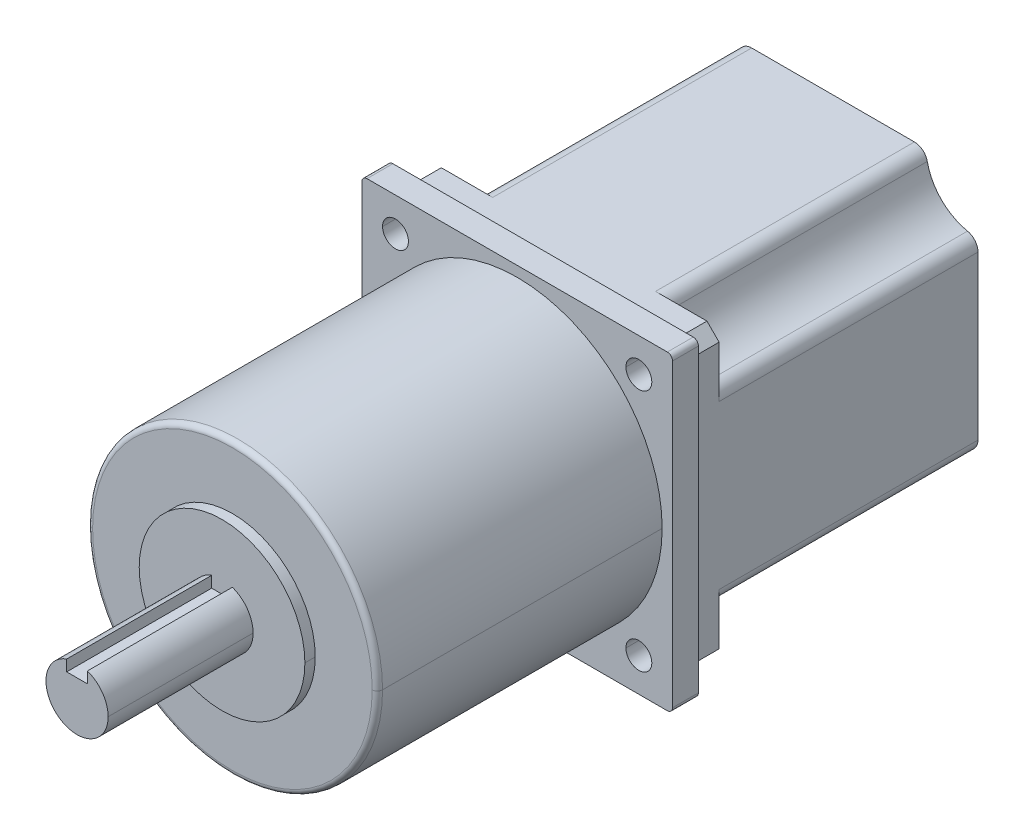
ISO-10303-21;
HEADER;
FILE_DESCRIPTION(('STEP AP214'),'2;1');
FILE_NAME('part.step','',(''),(''),'','','');
FILE_SCHEMA(('AUTOMOTIVE_DESIGN { 1 0 10303 214 1 1 1 1 }'));
ENDSEC;
DATA;
#1=APPLICATION_CONTEXT('core data for automotive mechanical design processes');
#2=APPLICATION_PROTOCOL_DEFINITION('international standard','automotive_design',2000,#1);
#3=PRODUCT_CONTEXT('',#1,'mechanical');
#4=PRODUCT('Part','Part','',(#3));
#5=PRODUCT_RELATED_PRODUCT_CATEGORY('part','',(#4));
#6=PRODUCT_DEFINITION_FORMATION('','',#4);
#7=PRODUCT_DEFINITION_CONTEXT('part definition',#1,'design');
#8=PRODUCT_DEFINITION('design','',#6,#7);
#9=PRODUCT_DEFINITION_SHAPE('','',#8);
#10=(LENGTH_UNIT() NAMED_UNIT(*) SI_UNIT(.MILLI.,.METRE.));
#11=(NAMED_UNIT(*) PLANE_ANGLE_UNIT() SI_UNIT($,.RADIAN.));
#12=(NAMED_UNIT(*) SI_UNIT($,.STERADIAN.) SOLID_ANGLE_UNIT());
#13=UNCERTAINTY_MEASURE_WITH_UNIT(LENGTH_MEASURE(1.E-05),#10,'distance_accuracy_value','');
#14=(GEOMETRIC_REPRESENTATION_CONTEXT(3) GLOBAL_UNCERTAINTY_ASSIGNED_CONTEXT((#13)) GLOBAL_UNIT_ASSIGNED_CONTEXT((#10,
#11,#12)) REPRESENTATION_CONTEXT('',''));
#15=CARTESIAN_POINT('',(0.,0.,0.));
#16=DIRECTION('',(0.,0.,1.));
#17=DIRECTION('',(1.,0.,0.));
#18=AXIS2_PLACEMENT_3D('',#15,#16,#17);
#19=CARTESIAN_POINT('',(29.,29.,116.));
#20=DIRECTION('',(0.,0.,-1.));
#21=DIRECTION('',(-1.,0.,0.));
#22=AXIS2_PLACEMENT_3D('',#19,#20,#21);
#23=CYLINDRICAL_SURFACE('',#22,1.);
#24=CARTESIAN_POINT('',(29.,29.,61.));
#25=DIRECTION('',(0.,0.,1.));
#26=DIRECTION('',(1.,0.,0.));
#27=AXIS2_PLACEMENT_3D('',#24,#25,#26);
#28=CIRCLE('',#27,1.);
#29=CARTESIAN_POINT('',(30.,29.,61.));
#30=VERTEX_POINT('',#29);
#31=CARTESIAN_POINT('',(29.,30.,61.));
#32=VERTEX_POINT('',#31);
#33=EDGE_CURVE('E772',#30,#32,#28,.T.);
#34=ORIENTED_EDGE('',*,*,#33,.F.);
#35=DIRECTION('',(0.,0.,1.));
#36=VECTOR('',#35,1.);
#37=CARTESIAN_POINT('',(30.,29.,116.));
#38=LINE('',#37,#36);
#39=CARTESIAN_POINT('',(30.,29.,56.));
#40=VERTEX_POINT('',#39);
#41=EDGE_CURVE('E938',#40,#30,#38,.T.);
#42=ORIENTED_EDGE('',*,*,#41,.F.);
#43=CARTESIAN_POINT('',(29.,29.,56.));
#44=DIRECTION('',(0.,0.,-1.));
#45=DIRECTION('',(-1.,0.,0.));
#46=AXIS2_PLACEMENT_3D('',#43,#44,#45);
#47=CIRCLE('',#46,1.);
#48=CARTESIAN_POINT('',(29.,30.,56.));
#49=VERTEX_POINT('',#48);
#50=EDGE_CURVE('E824',#49,#40,#47,.T.);
#51=ORIENTED_EDGE('',*,*,#50,.F.);
#52=DIRECTION('',(0.,0.,-1.));
#53=VECTOR('',#52,1.);
#54=CARTESIAN_POINT('',(29.,30.,116.));
#55=LINE('',#54,#53);
#56=EDGE_CURVE('E893',#32,#49,#55,.T.);
#57=ORIENTED_EDGE('',*,*,#56,.F.);
#58=EDGE_LOOP('',(#34,#42,#51,#57));
#59=FACE_BOUND('',#58,.T.);
#60=ADVANCED_FACE('F16',(#59),#23,.T.);
#61=CARTESIAN_POINT('',(29.,-29.,116.));
#62=DIRECTION('',(0.,0.,-1.));
#63=DIRECTION('',(-1.,0.,0.));
#64=AXIS2_PLACEMENT_3D('',#61,#62,#63);
#65=CYLINDRICAL_SURFACE('',#64,1.);
#66=CARTESIAN_POINT('',(29.,-29.,61.));
#67=DIRECTION('',(0.,0.,1.));
#68=DIRECTION('',(1.,0.,0.));
#69=AXIS2_PLACEMENT_3D('',#66,#67,#68);
#70=CIRCLE('',#69,1.);
#71=CARTESIAN_POINT('',(29.,-30.,61.));
#72=VERTEX_POINT('',#71);
#73=CARTESIAN_POINT('',(30.,-29.,61.));
#74=VERTEX_POINT('',#73);
#75=EDGE_CURVE('E778',#72,#74,#70,.T.);
#76=ORIENTED_EDGE('',*,*,#75,.F.);
#77=DIRECTION('',(0.,0.,1.));
#78=VECTOR('',#77,1.);
#79=CARTESIAN_POINT('',(29.,-30.,116.));
#80=LINE('',#79,#78);
#81=CARTESIAN_POINT('',(29.,-30.,56.));
#82=VERTEX_POINT('',#81);
#83=EDGE_CURVE('E835',#82,#72,#80,.T.);
#84=ORIENTED_EDGE('',*,*,#83,.F.);
#85=CARTESIAN_POINT('',(29.,-29.,56.));
#86=DIRECTION('',(0.,0.,-1.));
#87=DIRECTION('',(-1.,0.,0.));
#88=AXIS2_PLACEMENT_3D('',#85,#86,#87);
#89=CIRCLE('',#88,1.);
#90=CARTESIAN_POINT('',(30.,-29.,56.));
#91=VERTEX_POINT('',#90);
#92=EDGE_CURVE('E814',#91,#82,#89,.T.);
#93=ORIENTED_EDGE('',*,*,#92,.F.);
#94=DIRECTION('',(0.,0.,-1.));
#95=VECTOR('',#94,1.);
#96=CARTESIAN_POINT('',(30.,-29.,116.));
#97=LINE('',#96,#95);
#98=EDGE_CURVE('E957',#74,#91,#97,.T.);
#99=ORIENTED_EDGE('',*,*,#98,.F.);
#100=EDGE_LOOP('',(#76,#84,#93,#99));
#101=FACE_BOUND('',#100,.T.);
#102=ADVANCED_FACE('F1903',(#101),#65,.T.);
#103=CARTESIAN_POINT('',(-29.,29.,116.));
#104=DIRECTION('',(0.,0.,-1.));
#105=DIRECTION('',(-1.,0.,0.));
#106=AXIS2_PLACEMENT_3D('',#103,#104,#105);
#107=CYLINDRICAL_SURFACE('',#106,1.);
#108=CARTESIAN_POINT('',(-29.,29.,61.));
#109=DIRECTION('',(0.,0.,1.));
#110=DIRECTION('',(1.,0.,0.));
#111=AXIS2_PLACEMENT_3D('',#108,#109,#110);
#112=CIRCLE('',#111,1.);
#113=CARTESIAN_POINT('',(-29.,30.,61.));
#114=VERTEX_POINT('',#113);
#115=CARTESIAN_POINT('',(-30.,29.,61.));
#116=VERTEX_POINT('',#115);
#117=EDGE_CURVE('E765',#114,#116,#112,.T.);
#118=ORIENTED_EDGE('',*,*,#117,.F.);
#119=DIRECTION('',(0.,0.,1.));
#120=VECTOR('',#119,1.);
#121=CARTESIAN_POINT('',(-29.,30.,116.));
#122=LINE('',#121,#120);
#123=CARTESIAN_POINT('',(-29.,30.,56.));
#124=VERTEX_POINT('',#123);
#125=EDGE_CURVE('E907',#124,#114,#122,.T.);
#126=ORIENTED_EDGE('',*,*,#125,.F.);
#127=CARTESIAN_POINT('',(-29.,29.,56.));
#128=DIRECTION('',(0.,0.,-1.));
#129=DIRECTION('',(-1.,0.,0.));
#130=AXIS2_PLACEMENT_3D('',#127,#128,#129);
#131=CIRCLE('',#130,1.);
#132=CARTESIAN_POINT('',(-30.,29.,56.));
#133=VERTEX_POINT('',#132);
#134=EDGE_CURVE('E821',#133,#124,#131,.T.);
#135=ORIENTED_EDGE('',*,*,#134,.F.);
#136=DIRECTION('',(0.,0.,-1.));
#137=VECTOR('',#136,1.);
#138=CARTESIAN_POINT('',(-30.,29.,116.));
#139=LINE('',#138,#137);
#140=EDGE_CURVE('E875',#116,#133,#139,.T.);
#141=ORIENTED_EDGE('',*,*,#140,.F.);
#142=EDGE_LOOP('',(#118,#126,#135,#141));
#143=FACE_BOUND('',#142,.T.);
#144=ADVANCED_FACE('F1908',(#143),#107,.T.);
#145=CARTESIAN_POINT('',(-29.,-29.,116.));
#146=DIRECTION('',(0.,0.,-1.));
#147=DIRECTION('',(-1.,0.,0.));
#148=AXIS2_PLACEMENT_3D('',#145,#146,#147);
#149=CYLINDRICAL_SURFACE('',#148,1.);
#150=CARTESIAN_POINT('',(-29.,-29.,61.));
#151=DIRECTION('',(0.,0.,1.));
#152=DIRECTION('',(1.,0.,0.));
#153=AXIS2_PLACEMENT_3D('',#150,#151,#152);
#154=CIRCLE('',#153,1.);
#155=CARTESIAN_POINT('',(-30.,-29.,61.));
#156=VERTEX_POINT('',#155);
#157=CARTESIAN_POINT('',(-29.,-30.,61.));
#158=VERTEX_POINT('',#157);
#159=EDGE_CURVE('E786',#156,#158,#154,.T.);
#160=ORIENTED_EDGE('',*,*,#159,.F.);
#161=DIRECTION('',(0.,0.,1.));
#162=VECTOR('',#161,1.);
#163=CARTESIAN_POINT('',(-30.,-29.,116.));
#164=LINE('',#163,#162);
#165=CARTESIAN_POINT('',(-30.,-29.,56.));
#166=VERTEX_POINT('',#165);
#167=EDGE_CURVE('E873',#166,#156,#164,.T.);
#168=ORIENTED_EDGE('',*,*,#167,.F.);
#169=CARTESIAN_POINT('',(-29.,-29.,56.));
#170=DIRECTION('',(0.,0.,-1.));
#171=DIRECTION('',(-1.,0.,0.));
#172=AXIS2_PLACEMENT_3D('',#169,#170,#171);
#173=CIRCLE('',#172,1.);
#174=CARTESIAN_POINT('',(-29.,-30.,56.));
#175=VERTEX_POINT('',#174);
#176=EDGE_CURVE('E827',#175,#166,#173,.T.);
#177=ORIENTED_EDGE('',*,*,#176,.F.);
#178=DIRECTION('',(0.,0.,-1.));
#179=VECTOR('',#178,1.);
#180=CARTESIAN_POINT('',(-29.,-30.,116.));
#181=LINE('',#180,#179);
#182=EDGE_CURVE('E846',#158,#175,#181,.T.);
#183=ORIENTED_EDGE('',*,*,#182,.F.);
#184=EDGE_LOOP('',(#160,#168,#177,#183));
#185=FACE_BOUND('',#184,.T.);
#186=ADVANCED_FACE('F1932',(#185),#149,.T.);
#187=CARTESIAN_POINT('',(0.,0.,115.));
#188=DIRECTION('',(0.,0.,-1.));
#189=DIRECTION('',(-1.,0.,0.));
#190=AXIS2_PLACEMENT_3D('',#187,#188,#189);
#191=TOROIDAL_SURFACE('',#190,27.,1.);
#192=CARTESIAN_POINT('',(27.,0.,115.));
#193=DIRECTION('',(0.,1.,0.));
#194=DIRECTION('',(-1.,0.,0.));
#195=AXIS2_PLACEMENT_3D('',#192,#193,#194);
#196=CIRCLE('',#195,1.);
#197=CARTESIAN_POINT('',(27.,0.,116.));
#198=VERTEX_POINT('',#197);
#199=CARTESIAN_POINT('',(28.,0.,115.));
#200=VERTEX_POINT('',#199);
#201=EDGE_CURVE('E1719',#198,#200,#196,.T.);
#202=ORIENTED_EDGE('',*,*,#201,.F.);
#203=CARTESIAN_POINT('',(0.,0.,116.));
#204=DIRECTION('',(0.,0.,1.));
#205=DIRECTION('',(-1.,0.,0.));
#206=AXIS2_PLACEMENT_3D('',#203,#204,#205);
#207=CIRCLE('',#206,27.);
#208=CARTESIAN_POINT('',(-27.,0.,116.));
#209=VERTEX_POINT('',#208);
#210=EDGE_CURVE('E720',#209,#198,#207,.T.);
#211=ORIENTED_EDGE('',*,*,#210,.F.);
#212=CARTESIAN_POINT('',(-27.,0.,115.));
#213=DIRECTION('',(0.,-1.,0.));
#214=DIRECTION('',(0.,0.,-1.));
#215=AXIS2_PLACEMENT_3D('',#212,#213,#214);
#216=CIRCLE('',#215,1.);
#217=CARTESIAN_POINT('',(-28.,0.,115.));
#218=VERTEX_POINT('',#217);
#219=EDGE_CURVE('E1680',#209,#218,#216,.T.);
#220=ORIENTED_EDGE('',*,*,#219,.T.);
#221=CARTESIAN_POINT('',(0.,0.,115.));
#222=DIRECTION('',(0.,0.,-1.));
#223=DIRECTION('',(-1.,0.,0.));
#224=AXIS2_PLACEMENT_3D('',#221,#222,#223);
#225=CIRCLE('',#224,28.);
#226=EDGE_CURVE('E733',#200,#218,#225,.T.);
#227=ORIENTED_EDGE('',*,*,#226,.F.);
#228=EDGE_LOOP('',(#202,#211,#220,#227));
#229=FACE_BOUND('',#228,.T.);
#230=ADVANCED_FACE('F2575',(#229),#191,.T.);
#231=CARTESIAN_POINT('',(23.65,30.,64.9802561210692));
#232=DIRECTION('',(-0.707106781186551,-0.707106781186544,0.));
#233=DIRECTION('',(-0.707106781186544,0.707106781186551,0.));
#234=AXIS2_PLACEMENT_3D('',#231,#232,#233);
#235=PLANE('',#234);
#236=DIRECTION('',(-0.707106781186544,0.707106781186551,0.));
#237=VECTOR('',#236,1.);
#238=CARTESIAN_POINT('',(26.825,26.825,50.));
#239=LINE('',#238,#237);
#240=CARTESIAN_POINT('',(28.,25.65,50.));
#241=VERTEX_POINT('',#240);
#242=CARTESIAN_POINT('',(25.65,28.,50.));
#243=VERTEX_POINT('',#242);
#244=EDGE_CURVE('E630',#241,#243,#239,.T.);
#245=ORIENTED_EDGE('',*,*,#244,.T.);
#246=DIRECTION('',(0.,0.,-1.));
#247=VECTOR('',#246,1.);
#248=CARTESIAN_POINT('',(25.65,28.,56.));
#249=LINE('',#248,#247);
#250=CARTESIAN_POINT('',(25.65,28.,56.));
#251=VERTEX_POINT('',#250);
#252=EDGE_CURVE('E1211',#251,#243,#249,.T.);
#253=ORIENTED_EDGE('',*,*,#252,.F.);
#254=DIRECTION('',(0.707106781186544,-0.707106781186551,0.));
#255=VECTOR('',#254,1.);
#256=CARTESIAN_POINT('',(23.65,30.,56.));
#257=LINE('',#256,#255);
#258=CARTESIAN_POINT('',(28.,25.65,56.));
#259=VERTEX_POINT('',#258);
#260=EDGE_CURVE('E804',#251,#259,#257,.T.);
#261=ORIENTED_EDGE('',*,*,#260,.T.);
#262=DIRECTION('',(0.,0.,1.));
#263=VECTOR('',#262,1.);
#264=CARTESIAN_POINT('',(28.,25.65,56.));
#265=LINE('',#264,#263);
#266=EDGE_CURVE('E1310',#241,#259,#265,.T.);
#267=ORIENTED_EDGE('',*,*,#266,.F.);
#268=EDGE_LOOP('',(#245,#253,#261,#267));
#269=FACE_BOUND('',#268,.T.);
#270=ADVANCED_FACE('F1847',(#269),#235,.F.);
#271=CARTESIAN_POINT('',(23.65,-30.,64.9802561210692));
#272=DIRECTION('',(-0.707106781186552,0.707106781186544,0.));
#273=DIRECTION('',(0.,0.,1.));
#274=AXIS2_PLACEMENT_3D('',#271,#272,#273);
#275=PLANE('',#274);
#276=DIRECTION('',(-0.707106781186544,-0.707106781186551,0.));
#277=VECTOR('',#276,1.);
#278=CARTESIAN_POINT('',(23.65,-30.,56.));
#279=LINE('',#278,#277);
#280=CARTESIAN_POINT('',(28.,-25.65,56.));
#281=VERTEX_POINT('',#280);
#282=CARTESIAN_POINT('',(25.65,-28.,56.));
#283=VERTEX_POINT('',#282);
#284=EDGE_CURVE('E811',#281,#283,#279,.T.);
#285=ORIENTED_EDGE('',*,*,#284,.T.);
#286=DIRECTION('',(0.,0.,1.));
#287=VECTOR('',#286,1.);
#288=CARTESIAN_POINT('',(25.65,-28.,56.));
#289=LINE('',#288,#287);
#290=CARTESIAN_POINT('',(25.65,-28.,50.));
#291=VERTEX_POINT('',#290);
#292=EDGE_CURVE('E1100',#291,#283,#289,.T.);
#293=ORIENTED_EDGE('',*,*,#292,.F.);
#294=DIRECTION('',(0.707106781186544,0.707106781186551,0.));
#295=VECTOR('',#294,1.);
#296=CARTESIAN_POINT('',(26.825,-26.825,50.));
#297=LINE('',#296,#295);
#298=CARTESIAN_POINT('',(28.,-25.65,50.));
#299=VERTEX_POINT('',#298);
#300=EDGE_CURVE('E568',#291,#299,#297,.T.);
#301=ORIENTED_EDGE('',*,*,#300,.T.);
#302=DIRECTION('',(0.,0.,-1.));
#303=VECTOR('',#302,1.);
#304=CARTESIAN_POINT('',(28.,-25.65,56.));
#305=LINE('',#304,#303);
#306=EDGE_CURVE('E1276',#281,#299,#305,.T.);
#307=ORIENTED_EDGE('',*,*,#306,.F.);
#308=EDGE_LOOP('',(#285,#293,#301,#307));
#309=FACE_BOUND('',#308,.T.);
#310=ADVANCED_FACE('F1887',(#309),#275,.F.);
#311=CARTESIAN_POINT('',(-23.65,-30.,64.9802561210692));
#312=DIRECTION('',(0.707106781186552,0.707106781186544,0.));
#313=DIRECTION('',(0.,0.,-1.));
#314=AXIS2_PLACEMENT_3D('',#311,#312,#313);
#315=PLANE('',#314);
#316=DIRECTION('',(0.707106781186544,-0.707106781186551,0.));
#317=VECTOR('',#316,1.);
#318=CARTESIAN_POINT('',(-26.825,-26.825,50.));
#319=LINE('',#318,#317);
#320=CARTESIAN_POINT('',(-28.,-25.65,50.));
#321=VERTEX_POINT('',#320);
#322=CARTESIAN_POINT('',(-25.65,-28.,50.));
#323=VERTEX_POINT('',#322);
#324=EDGE_CURVE('E442',#321,#323,#319,.T.);
#325=ORIENTED_EDGE('',*,*,#324,.T.);
#326=DIRECTION('',(0.,0.,-1.));
#327=VECTOR('',#326,1.);
#328=CARTESIAN_POINT('',(-25.65,-28.,56.));
#329=LINE('',#328,#327);
#330=CARTESIAN_POINT('',(-25.65,-28.,56.));
#331=VERTEX_POINT('',#330);
#332=EDGE_CURVE('E1083',#331,#323,#329,.T.);
#333=ORIENTED_EDGE('',*,*,#332,.F.);
#334=DIRECTION('',(-0.707106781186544,0.707106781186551,0.));
#335=VECTOR('',#334,1.);
#336=CARTESIAN_POINT('',(-23.65,-30.,56.));
#337=LINE('',#336,#335);
#338=CARTESIAN_POINT('',(-28.,-25.65,56.));
#339=VERTEX_POINT('',#338);
#340=EDGE_CURVE('E792',#331,#339,#337,.T.);
#341=ORIENTED_EDGE('',*,*,#340,.T.);
#342=DIRECTION('',(0.,0.,1.));
#343=VECTOR('',#342,1.);
#344=CARTESIAN_POINT('',(-28.,-25.65,56.));
#345=LINE('',#344,#343);
#346=EDGE_CURVE('E1138',#321,#339,#345,.T.);
#347=ORIENTED_EDGE('',*,*,#346,.F.);
#348=EDGE_LOOP('',(#325,#333,#341,#347));
#349=FACE_BOUND('',#348,.T.);
#350=ADVANCED_FACE('F1886',(#349),#315,.F.);
#351=CARTESIAN_POINT('',(-23.65,30.,64.9802561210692));
#352=DIRECTION('',(0.707106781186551,-0.707106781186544,0.));
#353=DIRECTION('',(0.,0.,-1.));
#354=AXIS2_PLACEMENT_3D('',#351,#352,#353);
#355=PLANE('',#354);
#356=DIRECTION('',(-0.707106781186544,-0.707106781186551,0.));
#357=VECTOR('',#356,1.);
#358=CARTESIAN_POINT('',(-26.825,26.825,50.));
#359=LINE('',#358,#357);
#360=CARTESIAN_POINT('',(-25.65,28.,50.));
#361=VERTEX_POINT('',#360);
#362=CARTESIAN_POINT('',(-28.,25.65,50.));
#363=VERTEX_POINT('',#362);
#364=EDGE_CURVE('E472',#361,#363,#359,.T.);
#365=ORIENTED_EDGE('',*,*,#364,.T.);
#366=DIRECTION('',(0.,0.,-1.));
#367=VECTOR('',#366,1.);
#368=CARTESIAN_POINT('',(-28.,25.65,56.));
#369=LINE('',#368,#367);
#370=CARTESIAN_POINT('',(-28.,25.65,56.));
#371=VERTEX_POINT('',#370);
#372=EDGE_CURVE('E1233',#371,#363,#369,.T.);
#373=ORIENTED_EDGE('',*,*,#372,.F.);
#374=DIRECTION('',(0.707106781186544,0.707106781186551,0.));
#375=VECTOR('',#374,1.);
#376=CARTESIAN_POINT('',(-23.65,30.,56.));
#377=LINE('',#376,#375);
#378=CARTESIAN_POINT('',(-25.65,28.,56.));
#379=VERTEX_POINT('',#378);
#380=EDGE_CURVE('E800',#371,#379,#377,.T.);
#381=ORIENTED_EDGE('',*,*,#380,.T.);
#382=DIRECTION('',(0.,0.,1.));
#383=VECTOR('',#382,1.);
#384=CARTESIAN_POINT('',(-25.65,28.,56.));
#385=LINE('',#384,#383);
#386=EDGE_CURVE('E1160',#361,#379,#385,.T.);
#387=ORIENTED_EDGE('',*,*,#386,.F.);
#388=EDGE_LOOP('',(#365,#373,#381,#387));
#389=FACE_BOUND('',#388,.T.);
#390=ADVANCED_FACE('F1818',(#389),#355,.F.);
#391=CARTESIAN_POINT('',(23.5,23.5,146.));
#392=DIRECTION('',(0.,0.,-1.));
#393=DIRECTION('',(-1.,0.,0.));
#394=AXIS2_PLACEMENT_3D('',#391,#392,#393);
#395=CYLINDRICAL_SURFACE('',#394,2.5);
#396=DIRECTION('',(0.,0.,-1.));
#397=VECTOR('',#396,1.);
#398=CARTESIAN_POINT('',(26.,23.5,146.));
#399=LINE('',#398,#397);
#400=CARTESIAN_POINT('',(26.,23.5,61.));
#401=VERTEX_POINT('',#400);
#402=CARTESIAN_POINT('',(26.,23.5,50.));
#403=VERTEX_POINT('',#402);
#404=EDGE_CURVE('E1650',#401,#403,#399,.T.);
#405=ORIENTED_EDGE('',*,*,#404,.F.);
#406=CARTESIAN_POINT('',(23.5,23.5,61.));
#407=DIRECTION('',(0.,0.,1.));
#408=DIRECTION('',(1.,0.,0.));
#409=AXIS2_PLACEMENT_3D('',#406,#407,#408);
#410=CIRCLE('',#409,2.5);
#411=CARTESIAN_POINT('',(21.,23.5,61.));
#412=VERTEX_POINT('',#411);
#413=EDGE_CURVE('E738',#401,#412,#410,.T.);
#414=ORIENTED_EDGE('',*,*,#413,.T.);
#415=DIRECTION('',(0.,0.,-1.));
#416=VECTOR('',#415,1.);
#417=CARTESIAN_POINT('',(21.,23.5,146.));
#418=LINE('',#417,#416);
#419=CARTESIAN_POINT('',(21.,23.5,50.));
#420=VERTEX_POINT('',#419);
#421=EDGE_CURVE('E1607',#412,#420,#418,.T.);
#422=ORIENTED_EDGE('',*,*,#421,.T.);
#423=CARTESIAN_POINT('',(23.5,23.5,50.));
#424=DIRECTION('',(0.,0.,-1.));
#425=DIRECTION('',(-1.,0.,0.));
#426=AXIS2_PLACEMENT_3D('',#423,#424,#425);
#427=CIRCLE('',#426,2.5);
#428=EDGE_CURVE('E605',#420,#403,#427,.T.);
#429=ORIENTED_EDGE('',*,*,#428,.T.);
#430=EDGE_LOOP('',(#405,#414,#422,#429));
#431=FACE_BOUND('',#430,.T.);
#432=ADVANCED_FACE('F1786',(#431),#395,.F.);
#433=CARTESIAN_POINT('',(23.5,-23.5,146.));
#434=DIRECTION('',(0.,0.,-1.));
#435=DIRECTION('',(-1.,0.,0.));
#436=AXIS2_PLACEMENT_3D('',#433,#434,#435);
#437=CYLINDRICAL_SURFACE('',#436,2.5);
#438=DIRECTION('',(0.,0.,-1.));
#439=VECTOR('',#438,1.);
#440=CARTESIAN_POINT('',(26.,-23.5,146.));
#441=LINE('',#440,#439);
#442=CARTESIAN_POINT('',(26.,-23.5,61.));
#443=VERTEX_POINT('',#442);
#444=CARTESIAN_POINT('',(26.,-23.5,50.));
#445=VERTEX_POINT('',#444);
#446=EDGE_CURVE('E1575',#443,#445,#441,.T.);
#447=ORIENTED_EDGE('',*,*,#446,.F.);
#448=CARTESIAN_POINT('',(23.5,-23.5,61.));
#449=DIRECTION('',(0.,0.,1.));
#450=DIRECTION('',(1.,0.,0.));
#451=AXIS2_PLACEMENT_3D('',#448,#449,#450);
#452=CIRCLE('',#451,2.5);
#453=CARTESIAN_POINT('',(21.,-23.5,61.));
#454=VERTEX_POINT('',#453);
#455=EDGE_CURVE('E760',#443,#454,#452,.T.);
#456=ORIENTED_EDGE('',*,*,#455,.T.);
#457=DIRECTION('',(0.,0.,-1.));
#458=VECTOR('',#457,1.);
#459=CARTESIAN_POINT('',(21.,-23.5,146.));
#460=LINE('',#459,#458);
#461=CARTESIAN_POINT('',(21.,-23.5,50.));
#462=VERTEX_POINT('',#461);
#463=EDGE_CURVE('E1681',#454,#462,#460,.T.);
#464=ORIENTED_EDGE('',*,*,#463,.T.);
#465=CARTESIAN_POINT('',(23.5,-23.5,50.));
#466=DIRECTION('',(0.,0.,-1.));
#467=DIRECTION('',(-1.,0.,0.));
#468=AXIS2_PLACEMENT_3D('',#465,#466,#467);
#469=CIRCLE('',#468,2.5);
#470=EDGE_CURVE('E459',#462,#445,#469,.T.);
#471=ORIENTED_EDGE('',*,*,#470,.T.);
#472=EDGE_LOOP('',(#447,#456,#464,#471));
#473=FACE_BOUND('',#472,.T.);
#474=ADVANCED_FACE('F2007',(#473),#437,.F.);
#475=CARTESIAN_POINT('',(-23.5,-23.5,146.));
#476=DIRECTION('',(0.,0.,-1.));
#477=DIRECTION('',(-1.,0.,0.));
#478=AXIS2_PLACEMENT_3D('',#475,#476,#477);
#479=CYLINDRICAL_SURFACE('',#478,2.5);
#480=DIRECTION('',(0.,0.,-1.));
#481=VECTOR('',#480,1.);
#482=CARTESIAN_POINT('',(-21.,-23.5,146.));
#483=LINE('',#482,#481);
#484=CARTESIAN_POINT('',(-21.,-23.5,61.));
#485=VERTEX_POINT('',#484);
#486=CARTESIAN_POINT('',(-21.,-23.5,50.));
#487=VERTEX_POINT('',#486);
#488=EDGE_CURVE('E1600',#485,#487,#483,.T.);
#489=ORIENTED_EDGE('',*,*,#488,.F.);
#490=CARTESIAN_POINT('',(-23.5,-23.5,61.));
#491=DIRECTION('',(0.,0.,1.));
#492=DIRECTION('',(1.,0.,0.));
#493=AXIS2_PLACEMENT_3D('',#490,#491,#492);
#494=CIRCLE('',#493,2.5);
#495=CARTESIAN_POINT('',(-26.,-23.5,61.));
#496=VERTEX_POINT('',#495);
#497=EDGE_CURVE('E761',#485,#496,#494,.T.);
#498=ORIENTED_EDGE('',*,*,#497,.T.);
#499=DIRECTION('',(0.,0.,-1.));
#500=VECTOR('',#499,1.);
#501=CARTESIAN_POINT('',(-26.,-23.5,146.));
#502=LINE('',#501,#500);
#503=CARTESIAN_POINT('',(-26.,-23.5,50.));
#504=VERTEX_POINT('',#503);
#505=EDGE_CURVE('E1543',#496,#504,#502,.T.);
#506=ORIENTED_EDGE('',*,*,#505,.T.);
#507=CARTESIAN_POINT('',(-23.5,-23.5,50.));
#508=DIRECTION('',(0.,0.,-1.));
#509=DIRECTION('',(-1.,0.,0.));
#510=AXIS2_PLACEMENT_3D('',#507,#508,#509);
#511=CIRCLE('',#510,2.5);
#512=EDGE_CURVE('E467',#504,#487,#511,.T.);
#513=ORIENTED_EDGE('',*,*,#512,.T.);
#514=EDGE_LOOP('',(#489,#498,#506,#513));
#515=FACE_BOUND('',#514,.T.);
#516=ADVANCED_FACE('F1991',(#515),#479,.F.);
#517=CARTESIAN_POINT('',(-23.5,23.5,146.));
#518=DIRECTION('',(0.,0.,-1.));
#519=DIRECTION('',(-1.,0.,0.));
#520=AXIS2_PLACEMENT_3D('',#517,#518,#519);
#521=CYLINDRICAL_SURFACE('',#520,2.5);
#522=DIRECTION('',(0.,0.,-1.));
#523=VECTOR('',#522,1.);
#524=CARTESIAN_POINT('',(-21.,23.5,146.));
#525=LINE('',#524,#523);
#526=CARTESIAN_POINT('',(-21.,23.5,61.));
#527=VERTEX_POINT('',#526);
#528=CARTESIAN_POINT('',(-21.,23.5,50.));
#529=VERTEX_POINT('',#528);
#530=EDGE_CURVE('E1514',#527,#529,#525,.T.);
#531=ORIENTED_EDGE('',*,*,#530,.F.);
#532=CARTESIAN_POINT('',(-23.5,23.5,61.));
#533=DIRECTION('',(0.,0.,1.));
#534=DIRECTION('',(1.,0.,0.));
#535=AXIS2_PLACEMENT_3D('',#532,#533,#534);
#536=CIRCLE('',#535,2.5);
#537=CARTESIAN_POINT('',(-26.,23.5,61.));
#538=VERTEX_POINT('',#537);
#539=EDGE_CURVE('E742',#527,#538,#536,.T.);
#540=ORIENTED_EDGE('',*,*,#539,.T.);
#541=DIRECTION('',(0.,0.,-1.));
#542=VECTOR('',#541,1.);
#543=CARTESIAN_POINT('',(-26.,23.5,146.));
#544=LINE('',#543,#542);
#545=CARTESIAN_POINT('',(-26.,23.5,50.));
#546=VERTEX_POINT('',#545);
#547=EDGE_CURVE('E1488',#538,#546,#544,.T.);
#548=ORIENTED_EDGE('',*,*,#547,.T.);
#549=CARTESIAN_POINT('',(-23.5,23.5,50.));
#550=DIRECTION('',(0.,0.,-1.));
#551=DIRECTION('',(-1.,0.,0.));
#552=AXIS2_PLACEMENT_3D('',#549,#550,#551);
#553=CIRCLE('',#552,2.5);
#554=EDGE_CURVE('E484',#546,#529,#553,.T.);
#555=ORIENTED_EDGE('',*,*,#554,.T.);
#556=EDGE_LOOP('',(#531,#540,#548,#555));
#557=FACE_BOUND('',#556,.T.);
#558=ADVANCED_FACE('F1808',(#557),#521,.F.);
#559=CARTESIAN_POINT('',(15.719934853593,25.46,50.));
#560=DIRECTION('',(0.,0.,-1.));
#561=DIRECTION('',(-1.,0.,0.));
#562=AXIS2_PLACEMENT_3D('',#559,#560,#561);
#563=CYLINDRICAL_SURFACE('',#562,2.54);
#564=CARTESIAN_POINT('',(15.719934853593,25.46,50.));
#565=DIRECTION('',(0.,0.,1.));
#566=DIRECTION('',(-1.,0.,0.));
#567=AXIS2_PLACEMENT_3D('',#564,#565,#566);
#568=CIRCLE('',#567,2.54);
#569=CARTESIAN_POINT('',(18.2072845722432,25.9744816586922,50.));
#570=VERTEX_POINT('',#569);
#571=CARTESIAN_POINT('',(15.719934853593,28.,50.));
#572=VERTEX_POINT('',#571);
#573=EDGE_CURVE('E611',#570,#572,#568,.T.);
#574=ORIENTED_EDGE('',*,*,#573,.F.);
#575=DIRECTION('',(0.,0.,1.));
#576=VECTOR('',#575,1.);
#577=CARTESIAN_POINT('',(18.2072845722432,25.9744816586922,50.));
#578=LINE('',#577,#576);
#579=CARTESIAN_POINT('',(18.2072845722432,25.9744816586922,0.));
#580=VERTEX_POINT('',#579);
#581=EDGE_CURVE('E634',#580,#570,#578,.T.);
#582=ORIENTED_EDGE('',*,*,#581,.F.);
#583=CARTESIAN_POINT('',(15.719934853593,25.46,0.));
#584=DIRECTION('',(0.,0.,-1.));
#585=DIRECTION('',(-1.,0.,0.));
#586=AXIS2_PLACEMENT_3D('',#583,#584,#585);
#587=CIRCLE('',#586,2.54);
#588=CARTESIAN_POINT('',(15.719934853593,28.,0.));
#589=VERTEX_POINT('',#588);
#590=EDGE_CURVE('E1019',#589,#580,#587,.T.);
#591=ORIENTED_EDGE('',*,*,#590,.F.);
#592=DIRECTION('',(0.,0.,-1.));
#593=VECTOR('',#592,1.);
#594=CARTESIAN_POINT('',(15.719934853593,28.,0.));
#595=LINE('',#594,#593);
#596=EDGE_CURVE('E1203',#572,#589,#595,.T.);
#597=ORIENTED_EDGE('',*,*,#596,.F.);
#598=EDGE_LOOP('',(#574,#582,#591,#597));
#599=FACE_BOUND('',#598,.T.);
#600=ADVANCED_FACE('F1851',(#599),#563,.T.);
#601=CARTESIAN_POINT('',(25.46,15.719934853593,50.));
#602=DIRECTION('',(0.,0.,-1.));
#603=DIRECTION('',(-1.,0.,0.));
#604=AXIS2_PLACEMENT_3D('',#601,#602,#603);
#605=CYLINDRICAL_SURFACE('',#604,2.54);
#606=CARTESIAN_POINT('',(25.46,15.719934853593,50.));
#607=DIRECTION('',(0.,0.,1.));
#608=DIRECTION('',(-1.,0.,0.));
#609=AXIS2_PLACEMENT_3D('',#606,#607,#608);
#610=CIRCLE('',#609,2.54);
#611=CARTESIAN_POINT('',(28.,15.719934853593,50.));
#612=VERTEX_POINT('',#611);
#613=CARTESIAN_POINT('',(25.9744816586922,18.2072845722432,50.));
#614=VERTEX_POINT('',#613);
#615=EDGE_CURVE('E616',#612,#614,#610,.T.);
#616=ORIENTED_EDGE('',*,*,#615,.F.);
#617=DIRECTION('',(0.,0.,1.));
#618=VECTOR('',#617,1.);
#619=CARTESIAN_POINT('',(28.,15.719934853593,50.));
#620=LINE('',#619,#618);
#621=CARTESIAN_POINT('',(28.,15.719934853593,0.));
#622=VERTEX_POINT('',#621);
#623=EDGE_CURVE('E1228',#622,#612,#620,.T.);
#624=ORIENTED_EDGE('',*,*,#623,.F.);
#625=CARTESIAN_POINT('',(25.46,15.719934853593,0.));
#626=DIRECTION('',(0.,0.,-1.));
#627=DIRECTION('',(-1.,0.,0.));
#628=AXIS2_PLACEMENT_3D('',#625,#626,#627);
#629=CIRCLE('',#628,2.54);
#630=CARTESIAN_POINT('',(25.9744816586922,18.2072845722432,0.));
#631=VERTEX_POINT('',#630);
#632=EDGE_CURVE('E1010',#631,#622,#629,.T.);
#633=ORIENTED_EDGE('',*,*,#632,.F.);
#634=DIRECTION('',(0.,0.,-1.));
#635=VECTOR('',#634,1.);
#636=CARTESIAN_POINT('',(25.9744816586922,18.2072845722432,50.));
#637=LINE('',#636,#635);
#638=EDGE_CURVE('E643',#614,#631,#637,.T.);
#639=ORIENTED_EDGE('',*,*,#638,.F.);
#640=EDGE_LOOP('',(#616,#624,#633,#639));
#641=FACE_BOUND('',#640,.T.);
#642=ADVANCED_FACE('F1865',(#641),#605,.T.);
#643=CARTESIAN_POINT('',(25.46,-15.719934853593,50.));
#644=DIRECTION('',(0.,0.,-1.));
#645=DIRECTION('',(-1.,0.,0.));
#646=AXIS2_PLACEMENT_3D('',#643,#644,#645);
#647=CYLINDRICAL_SURFACE('',#646,2.54);
#648=CARTESIAN_POINT('',(25.46,-15.719934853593,50.));
#649=DIRECTION('',(0.,0.,1.));
#650=DIRECTION('',(-1.,0.,0.));
#651=AXIS2_PLACEMENT_3D('',#648,#649,#650);
#652=CIRCLE('',#651,2.54);
#653=CARTESIAN_POINT('',(25.9744816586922,-18.2072845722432,50.));
#654=VERTEX_POINT('',#653);
#655=CARTESIAN_POINT('',(28.,-15.719934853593,50.));
#656=VERTEX_POINT('',#655);
#657=EDGE_CURVE('E554',#654,#656,#652,.T.);
#658=ORIENTED_EDGE('',*,*,#657,.F.);
#659=DIRECTION('',(0.,0.,1.));
#660=VECTOR('',#659,1.);
#661=CARTESIAN_POINT('',(25.9744816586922,-18.2072845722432,50.));
#662=LINE('',#661,#660);
#663=CARTESIAN_POINT('',(25.9744816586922,-18.2072845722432,0.));
#664=VERTEX_POINT('',#663);
#665=EDGE_CURVE('E576',#664,#654,#662,.T.);
#666=ORIENTED_EDGE('',*,*,#665,.F.);
#667=CARTESIAN_POINT('',(25.46,-15.719934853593,0.));
#668=DIRECTION('',(0.,0.,-1.));
#669=DIRECTION('',(-1.,0.,0.));
#670=AXIS2_PLACEMENT_3D('',#667,#668,#669);
#671=CIRCLE('',#670,2.54);
#672=CARTESIAN_POINT('',(28.,-15.719934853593,0.));
#673=VERTEX_POINT('',#672);
#674=EDGE_CURVE('E991',#673,#664,#671,.T.);
#675=ORIENTED_EDGE('',*,*,#674,.F.);
#676=DIRECTION('',(0.,0.,-1.));
#677=VECTOR('',#676,1.);
#678=CARTESIAN_POINT('',(28.,-15.719934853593,0.));
#679=LINE('',#678,#677);
#680=EDGE_CURVE('E1260',#656,#673,#679,.T.);
#681=ORIENTED_EDGE('',*,*,#680,.F.);
#682=EDGE_LOOP('',(#658,#666,#675,#681));
#683=FACE_BOUND('',#682,.T.);
#684=ADVANCED_FACE('F1868',(#683),#647,.T.);
#685=CARTESIAN_POINT('',(15.719934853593,-25.46,50.));
#686=DIRECTION('',(0.,0.,-1.));
#687=DIRECTION('',(-1.,0.,0.));
#688=AXIS2_PLACEMENT_3D('',#685,#686,#687);
#689=CYLINDRICAL_SURFACE('',#688,2.54);
#690=CARTESIAN_POINT('',(15.719934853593,-25.46,50.));
#691=DIRECTION('',(0.,0.,1.));
#692=DIRECTION('',(-1.,0.,0.));
#693=AXIS2_PLACEMENT_3D('',#690,#691,#692);
#694=CIRCLE('',#693,2.54);
#695=CARTESIAN_POINT('',(15.719934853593,-28.,50.));
#696=VERTEX_POINT('',#695);
#697=CARTESIAN_POINT('',(18.2072845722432,-25.9744816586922,50.));
#698=VERTEX_POINT('',#697);
#699=EDGE_CURVE('E560',#696,#698,#694,.T.);
#700=ORIENTED_EDGE('',*,*,#699,.F.);
#701=DIRECTION('',(0.,0.,1.));
#702=VECTOR('',#701,1.);
#703=CARTESIAN_POINT('',(15.719934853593,-28.,50.));
#704=LINE('',#703,#702);
#705=CARTESIAN_POINT('',(15.719934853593,-28.,0.));
#706=VERTEX_POINT('',#705);
#707=EDGE_CURVE('E1051',#706,#696,#704,.T.);
#708=ORIENTED_EDGE('',*,*,#707,.F.);
#709=CARTESIAN_POINT('',(15.719934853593,-25.46,0.));
#710=DIRECTION('',(0.,0.,-1.));
#711=DIRECTION('',(-1.,0.,0.));
#712=AXIS2_PLACEMENT_3D('',#709,#710,#711);
#713=CIRCLE('',#712,2.54);
#714=CARTESIAN_POINT('',(18.2072845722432,-25.9744816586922,0.));
#715=VERTEX_POINT('',#714);
#716=EDGE_CURVE('E983',#715,#706,#713,.T.);
#717=ORIENTED_EDGE('',*,*,#716,.F.);
#718=DIRECTION('',(0.,0.,-1.));
#719=VECTOR('',#718,1.);
#720=CARTESIAN_POINT('',(18.2072845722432,-25.9744816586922,50.));
#721=LINE('',#720,#719);
#722=EDGE_CURVE('E584',#698,#715,#721,.T.);
#723=ORIENTED_EDGE('',*,*,#722,.F.);
#724=EDGE_LOOP('',(#700,#708,#717,#723));
#725=FACE_BOUND('',#724,.T.);
#726=ADVANCED_FACE('F1877',(#725),#689,.T.);
#727=CARTESIAN_POINT('',(-15.719934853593,25.46,50.));
#728=DIRECTION('',(0.,0.,-1.));
#729=DIRECTION('',(-1.,0.,0.));
#730=AXIS2_PLACEMENT_3D('',#727,#728,#729);
#731=CYLINDRICAL_SURFACE('',#730,2.54);
#732=CARTESIAN_POINT('',(-15.719934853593,25.46,50.));
#733=DIRECTION('',(0.,0.,1.));
#734=DIRECTION('',(-1.,0.,0.));
#735=AXIS2_PLACEMENT_3D('',#732,#733,#734);
#736=CIRCLE('',#735,2.54);
#737=CARTESIAN_POINT('',(-15.719934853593,28.,50.));
#738=VERTEX_POINT('',#737);
#739=CARTESIAN_POINT('',(-18.2072845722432,25.9744816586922,50.));
#740=VERTEX_POINT('',#739);
#741=EDGE_CURVE('E474',#738,#740,#736,.T.);
#742=ORIENTED_EDGE('',*,*,#741,.F.);
#743=DIRECTION('',(0.,0.,1.));
#744=VECTOR('',#743,1.);
#745=CARTESIAN_POINT('',(-15.719934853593,28.,50.));
#746=LINE('',#745,#744);
#747=CARTESIAN_POINT('',(-15.719934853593,28.,0.));
#748=VERTEX_POINT('',#747);
#749=EDGE_CURVE('E1186',#748,#738,#746,.T.);
#750=ORIENTED_EDGE('',*,*,#749,.F.);
#751=CARTESIAN_POINT('',(-15.719934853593,25.46,0.));
#752=DIRECTION('',(0.,0.,-1.));
#753=DIRECTION('',(-1.,0.,0.));
#754=AXIS2_PLACEMENT_3D('',#751,#752,#753);
#755=CIRCLE('',#754,2.54);
#756=CARTESIAN_POINT('',(-18.2072845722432,25.9744816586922,0.));
#757=VERTEX_POINT('',#756);
#758=EDGE_CURVE('E1016',#757,#748,#755,.T.);
#759=ORIENTED_EDGE('',*,*,#758,.F.);
#760=DIRECTION('',(0.,0.,-1.));
#761=VECTOR('',#760,1.);
#762=CARTESIAN_POINT('',(-18.2072845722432,25.9744816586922,50.));
#763=LINE('',#762,#761);
#764=EDGE_CURVE('E11',#740,#757,#763,.T.);
#765=ORIENTED_EDGE('',*,*,#764,.F.);
#766=EDGE_LOOP('',(#742,#750,#759,#765));
#767=FACE_BOUND('',#766,.T.);
#768=ADVANCED_FACE('F1829',(#767),#731,.T.);
#769=CARTESIAN_POINT('',(-25.46,15.719934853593,50.));
#770=DIRECTION('',(0.,0.,-1.));
#771=DIRECTION('',(-1.,0.,0.));
#772=AXIS2_PLACEMENT_3D('',#769,#770,#771);
#773=CYLINDRICAL_SURFACE('',#772,2.54);
#774=CARTESIAN_POINT('',(-25.46,15.719934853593,50.));
#775=DIRECTION('',(0.,0.,1.));
#776=DIRECTION('',(-1.,0.,0.));
#777=AXIS2_PLACEMENT_3D('',#774,#775,#776);
#778=CIRCLE('',#777,2.54);
#779=CARTESIAN_POINT('',(-25.9744816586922,18.2072845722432,50.));
#780=VERTEX_POINT('',#779);
#781=CARTESIAN_POINT('',(-28.,15.719934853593,50.));
#782=VERTEX_POINT('',#781);
#783=EDGE_CURVE('E485',#780,#782,#778,.T.);
#784=ORIENTED_EDGE('',*,*,#783,.F.);
#785=DIRECTION('',(0.,0.,1.));
#786=VECTOR('',#785,1.);
#787=CARTESIAN_POINT('',(-25.9744816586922,18.2072845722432,50.));
#788=LINE('',#787,#786);
#789=CARTESIAN_POINT('',(-25.9744816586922,18.2072845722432,0.));
#790=VERTEX_POINT('',#789);
#791=EDGE_CURVE('E25',#790,#780,#788,.T.);
#792=ORIENTED_EDGE('',*,*,#791,.F.);
#793=CARTESIAN_POINT('',(-25.46,15.719934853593,0.));
#794=DIRECTION('',(0.,0.,-1.));
#795=DIRECTION('',(-1.,0.,0.));
#796=AXIS2_PLACEMENT_3D('',#793,#794,#795);
#797=CIRCLE('',#796,2.54);
#798=CARTESIAN_POINT('',(-28.,15.719934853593,0.));
#799=VERTEX_POINT('',#798);
#800=EDGE_CURVE('E1031',#799,#790,#797,.T.);
#801=ORIENTED_EDGE('',*,*,#800,.F.);
#802=DIRECTION('',(0.,0.,-1.));
#803=VECTOR('',#802,1.);
#804=CARTESIAN_POINT('',(-28.,15.719934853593,0.));
#805=LINE('',#804,#803);
#806=EDGE_CURVE('E1316',#782,#799,#805,.T.);
#807=ORIENTED_EDGE('',*,*,#806,.F.);
#808=EDGE_LOOP('',(#784,#792,#801,#807));
#809=FACE_BOUND('',#808,.T.);
#810=ADVANCED_FACE('F1836',(#809),#773,.T.);
#811=CARTESIAN_POINT('',(-25.46,-15.719934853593,50.));
#812=DIRECTION('',(0.,0.,-1.));
#813=DIRECTION('',(-1.,0.,0.));
#814=AXIS2_PLACEMENT_3D('',#811,#812,#813);
#815=CYLINDRICAL_SURFACE('',#814,2.54);
#816=CARTESIAN_POINT('',(-25.46,-15.719934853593,50.));
#817=DIRECTION('',(0.,0.,1.));
#818=DIRECTION('',(-1.,0.,0.));
#819=AXIS2_PLACEMENT_3D('',#816,#817,#818);
#820=CIRCLE('',#819,2.54);
#821=CARTESIAN_POINT('',(-28.,-15.719934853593,50.));
#822=VERTEX_POINT('',#821);
#823=CARTESIAN_POINT('',(-25.9744816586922,-18.2072845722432,50.));
#824=VERTEX_POINT('',#823);
#825=EDGE_CURVE('E428',#822,#824,#820,.T.);
#826=ORIENTED_EDGE('',*,*,#825,.F.);
#827=DIRECTION('',(0.,0.,1.));
#828=VECTOR('',#827,1.);
#829=CARTESIAN_POINT('',(-28.,-15.719934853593,50.));
#830=LINE('',#829,#828);
#831=CARTESIAN_POINT('',(-28.,-15.719934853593,0.));
#832=VERTEX_POINT('',#831);
#833=EDGE_CURVE('E1125',#832,#822,#830,.T.);
#834=ORIENTED_EDGE('',*,*,#833,.F.);
#835=CARTESIAN_POINT('',(-25.46,-15.719934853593,0.));
#836=DIRECTION('',(0.,0.,-1.));
#837=DIRECTION('',(-1.,0.,0.));
#838=AXIS2_PLACEMENT_3D('',#835,#836,#837);
#839=CIRCLE('',#838,2.54);
#840=CARTESIAN_POINT('',(-25.9744816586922,-18.2072845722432,0.));
#841=VERTEX_POINT('',#840);
#842=EDGE_CURVE('E446',#841,#832,#839,.T.);
#843=ORIENTED_EDGE('',*,*,#842,.F.);
#844=DIRECTION('',(0.,0.,-1.));
#845=VECTOR('',#844,1.);
#846=CARTESIAN_POINT('',(-25.9744816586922,-18.2072845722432,50.));
#847=LINE('',#846,#845);
#848=EDGE_CURVE('E441',#824,#841,#847,.T.);
#849=ORIENTED_EDGE('',*,*,#848,.F.);
#850=EDGE_LOOP('',(#826,#834,#843,#849));
#851=FACE_BOUND('',#850,.T.);
#852=ADVANCED_FACE('F443',(#851),#815,.T.);
#853=CARTESIAN_POINT('',(-15.719934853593,-25.46,50.));
#854=DIRECTION('',(0.,0.,-1.));
#855=DIRECTION('',(-1.,0.,0.));
#856=AXIS2_PLACEMENT_3D('',#853,#854,#855);
#857=CYLINDRICAL_SURFACE('',#856,2.54);
#858=CARTESIAN_POINT('',(-15.719934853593,-25.46,50.));
#859=DIRECTION('',(0.,0.,1.));
#860=DIRECTION('',(-1.,0.,0.));
#861=AXIS2_PLACEMENT_3D('',#858,#859,#860);
#862=CIRCLE('',#861,2.54);
#863=CARTESIAN_POINT('',(-18.2072845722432,-25.9744816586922,50.));
#864=VERTEX_POINT('',#863);
#865=CARTESIAN_POINT('',(-15.719934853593,-28.,50.));
#866=VERTEX_POINT('',#865);
#867=EDGE_CURVE('E439',#864,#866,#862,.T.);
#868=ORIENTED_EDGE('',*,*,#867,.F.);
#869=DIRECTION('',(0.,0.,1.));
#870=VECTOR('',#869,1.);
#871=CARTESIAN_POINT('',(-18.2072845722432,-25.9744816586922,50.));
#872=LINE('',#871,#870);
#873=CARTESIAN_POINT('',(-18.2072845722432,-25.9744816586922,0.));
#874=VERTEX_POINT('',#873);
#875=EDGE_CURVE('E454',#874,#864,#872,.T.);
#876=ORIENTED_EDGE('',*,*,#875,.F.);
#877=CARTESIAN_POINT('',(-15.719934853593,-25.46,0.));
#878=DIRECTION('',(0.,0.,-1.));
#879=DIRECTION('',(-1.,0.,0.));
#880=AXIS2_PLACEMENT_3D('',#877,#878,#879);
#881=CIRCLE('',#880,2.54);
#882=CARTESIAN_POINT('',(-15.719934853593,-28.,0.));
#883=VERTEX_POINT('',#882);
#884=EDGE_CURVE('E1047',#883,#874,#881,.T.);
#885=ORIENTED_EDGE('',*,*,#884,.F.);
#886=DIRECTION('',(0.,0.,-1.));
#887=VECTOR('',#886,1.);
#888=CARTESIAN_POINT('',(-15.719934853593,-28.,0.));
#889=LINE('',#888,#887);
#890=EDGE_CURVE('E1068',#866,#883,#889,.T.);
#891=ORIENTED_EDGE('',*,*,#890,.F.);
#892=EDGE_LOOP('',(#868,#876,#885,#891));
#893=FACE_BOUND('',#892,.T.);
#894=ADVANCED_FACE('F1881',(#893),#857,.T.);
#895=CARTESIAN_POINT('',(-28.,28.,50.));
#896=DIRECTION('',(0.,0.,-1.));
#897=DIRECTION('',(-1.,0.,0.));
#898=AXIS2_PLACEMENT_3D('',#895,#896,#897);
#899=CYLINDRICAL_SURFACE('',#898,10.);
#900=CARTESIAN_POINT('',(-28.,28.,0.));
#901=DIRECTION('',(0.,0.,1.));
#902=DIRECTION('',(-1.,0.,0.));
#903=AXIS2_PLACEMENT_3D('',#900,#901,#902);
#904=CIRCLE('',#903,10.);
#905=EDGE_CURVE('E1023',#790,#757,#904,.T.);
#906=ORIENTED_EDGE('',*,*,#905,.F.);
#907=ORIENTED_EDGE('',*,*,#791,.T.);
#908=CARTESIAN_POINT('',(-28.,28.,50.));
#909=DIRECTION('',(0.,0.,1.));
#910=DIRECTION('',(-1.,0.,0.));
#911=AXIS2_PLACEMENT_3D('',#908,#909,#910);
#912=CIRCLE('',#911,10.);
#913=EDGE_CURVE('E479',#780,#740,#912,.T.);
#914=ORIENTED_EDGE('',*,*,#913,.T.);
#915=ORIENTED_EDGE('',*,*,#764,.T.);
#916=EDGE_LOOP('',(#906,#907,#914,#915));
#917=FACE_BOUND('',#916,.T.);
#918=ADVANCED_FACE('F1812',(#917),#899,.F.);
#919=CARTESIAN_POINT('',(0.,0.,50.));
#920=DIRECTION('',(0.,0.,-1.));
#921=DIRECTION('',(0.,-1.,0.));
#922=AXIS2_PLACEMENT_3D('',#919,#920,#921);
#923=PLANE('',#922);
#924=ORIENTED_EDGE('',*,*,#554,.F.);
#925=CARTESIAN_POINT('',(-23.5,23.5,50.));
#926=DIRECTION('',(0.,0.,-1.));
#927=DIRECTION('',(-1.,0.,0.));
#928=AXIS2_PLACEMENT_3D('',#925,#926,#927);
#929=CIRCLE('',#928,2.5);
#930=EDGE_CURVE('E1496',#529,#546,#929,.T.);
#931=ORIENTED_EDGE('',*,*,#930,.F.);
#932=EDGE_LOOP('',(#924,#931));
#933=FACE_BOUND('',#932,.T.);
#934=ORIENTED_EDGE('',*,*,#364,.F.);
#935=DIRECTION('',(1.,0.,0.));
#936=VECTOR('',#935,1.);
#937=CARTESIAN_POINT('',(-28.,28.,50.));
#938=LINE('',#937,#936);
#939=EDGE_CURVE('E1178',#361,#738,#938,.T.);
#940=ORIENTED_EDGE('',*,*,#939,.T.);
#941=ORIENTED_EDGE('',*,*,#741,.T.);
#942=ORIENTED_EDGE('',*,*,#913,.F.);
#943=ORIENTED_EDGE('',*,*,#783,.T.);
#944=DIRECTION('',(0.,1.,0.));
#945=VECTOR('',#944,1.);
#946=CARTESIAN_POINT('',(-28.,-28.,50.));
#947=LINE('',#946,#945);
#948=EDGE_CURVE('E1237',#782,#363,#947,.T.);
#949=ORIENTED_EDGE('',*,*,#948,.T.);
#950=EDGE_LOOP('',(#934,#940,#941,#942,#943,#949));
#951=FACE_BOUND('',#950,.T.);
#952=ADVANCED_FACE('F1809',(#933,#951),#923,.T.);
#953=CARTESIAN_POINT('',(0.,0.,50.));
#954=DIRECTION('',(0.,0.,-1.));
#955=DIRECTION('',(0.,-1.,0.));
#956=AXIS2_PLACEMENT_3D('',#953,#954,#955);
#957=PLANE('',#956);
#958=ORIENTED_EDGE('',*,*,#512,.F.);
#959=CARTESIAN_POINT('',(-23.5,-23.5,50.));
#960=DIRECTION('',(0.,0.,-1.));
#961=DIRECTION('',(-1.,0.,0.));
#962=AXIS2_PLACEMENT_3D('',#959,#960,#961);
#963=CIRCLE('',#962,2.5);
#964=EDGE_CURVE('E1551',#487,#504,#963,.T.);
#965=ORIENTED_EDGE('',*,*,#964,.F.);
#966=EDGE_LOOP('',(#958,#965));
#967=FACE_BOUND('',#966,.T.);
#968=ORIENTED_EDGE('',*,*,#324,.F.);
#969=DIRECTION('',(0.,1.,0.));
#970=VECTOR('',#969,1.);
#971=CARTESIAN_POINT('',(-28.,-28.,50.));
#972=LINE('',#971,#970);
#973=EDGE_CURVE('E434',#321,#822,#972,.T.);
#974=ORIENTED_EDGE('',*,*,#973,.T.);
#975=ORIENTED_EDGE('',*,*,#825,.T.);
#976=CARTESIAN_POINT('',(-28.,-28.,50.));
#977=DIRECTION('',(0.,0.,1.));
#978=DIRECTION('',(-1.,0.,0.));
#979=AXIS2_PLACEMENT_3D('',#976,#977,#978);
#980=CIRCLE('',#979,10.);
#981=EDGE_CURVE('E435',#864,#824,#980,.T.);
#982=ORIENTED_EDGE('',*,*,#981,.F.);
#983=ORIENTED_EDGE('',*,*,#867,.T.);
#984=DIRECTION('',(-1.,0.,0.));
#985=VECTOR('',#984,1.);
#986=CARTESIAN_POINT('',(-28.,-28.,50.));
#987=LINE('',#986,#985);
#988=EDGE_CURVE('E1086',#866,#323,#987,.T.);
#989=ORIENTED_EDGE('',*,*,#988,.T.);
#990=EDGE_LOOP('',(#968,#974,#975,#982,#983,#989));
#991=FACE_BOUND('',#990,.T.);
#992=ADVANCED_FACE('F429',(#967,#991),#957,.T.);
#993=CARTESIAN_POINT('',(-28.,-28.,50.));
#994=DIRECTION('',(0.,0.,-1.));
#995=DIRECTION('',(-1.,0.,0.));
#996=AXIS2_PLACEMENT_3D('',#993,#994,#995);
#997=CYLINDRICAL_SURFACE('',#996,10.);
#998=CARTESIAN_POINT('',(-28.,-28.,0.));
#999=DIRECTION('',(0.,0.,1.));
#1000=DIRECTION('',(-1.,0.,0.));
#1001=AXIS2_PLACEMENT_3D('',#998,#999,#1000);
#1002=CIRCLE('',#1001,10.);
#1003=EDGE_CURVE('E1039',#874,#841,#1002,.T.);
#1004=ORIENTED_EDGE('',*,*,#1003,.F.);
#1005=ORIENTED_EDGE('',*,*,#875,.T.);
#1006=ORIENTED_EDGE('',*,*,#981,.T.);
#1007=ORIENTED_EDGE('',*,*,#848,.T.);
#1008=EDGE_LOOP('',(#1004,#1005,#1006,#1007));
#1009=FACE_BOUND('',#1008,.T.);
#1010=ADVANCED_FACE('F455',(#1009),#997,.F.);
#1011=CARTESIAN_POINT('',(0.,0.,50.));
#1012=DIRECTION('',(0.,0.,-1.));
#1013=DIRECTION('',(0.,-1.,0.));
#1014=AXIS2_PLACEMENT_3D('',#1011,#1012,#1013);
#1015=PLANE('',#1014);
#1016=ORIENTED_EDGE('',*,*,#470,.F.);
#1017=CARTESIAN_POINT('',(23.5,-23.5,50.));
#1018=DIRECTION('',(0.,0.,-1.));
#1019=DIRECTION('',(-1.,0.,0.));
#1020=AXIS2_PLACEMENT_3D('',#1017,#1018,#1019);
#1021=CIRCLE('',#1020,2.5);
#1022=EDGE_CURVE('E1579',#445,#462,#1021,.T.);
#1023=ORIENTED_EDGE('',*,*,#1022,.F.);
#1024=EDGE_LOOP('',(#1016,#1023));
#1025=FACE_BOUND('',#1024,.T.);
#1026=ORIENTED_EDGE('',*,*,#300,.F.);
#1027=DIRECTION('',(-1.,0.,0.));
#1028=VECTOR('',#1027,1.);
#1029=CARTESIAN_POINT('',(-28.,-28.,50.));
#1030=LINE('',#1029,#1028);
#1031=EDGE_CURVE('E1116',#291,#696,#1030,.T.);
#1032=ORIENTED_EDGE('',*,*,#1031,.T.);
#1033=ORIENTED_EDGE('',*,*,#699,.T.);
#1034=CARTESIAN_POINT('',(28.,-28.,50.));
#1035=DIRECTION('',(0.,0.,1.));
#1036=DIRECTION('',(-1.,0.,0.));
#1037=AXIS2_PLACEMENT_3D('',#1034,#1035,#1036);
#1038=CIRCLE('',#1037,10.);
#1039=EDGE_CURVE('E593',#654,#698,#1038,.T.);
#1040=ORIENTED_EDGE('',*,*,#1039,.F.);
#1041=ORIENTED_EDGE('',*,*,#657,.T.);
#1042=DIRECTION('',(0.,-1.,0.));
#1043=VECTOR('',#1042,1.);
#1044=CARTESIAN_POINT('',(28.,-28.,50.));
#1045=LINE('',#1044,#1043);
#1046=EDGE_CURVE('E1267',#656,#299,#1045,.T.);
#1047=ORIENTED_EDGE('',*,*,#1046,.T.);
#1048=EDGE_LOOP('',(#1026,#1032,#1033,#1040,#1041,#1047));
#1049=FACE_BOUND('',#1048,.T.);
#1050=ADVANCED_FACE('F1947',(#1025,#1049),#1015,.T.);
#1051=CARTESIAN_POINT('',(28.,-28.,50.));
#1052=DIRECTION('',(0.,0.,-1.));
#1053=DIRECTION('',(-1.,0.,0.));
#1054=AXIS2_PLACEMENT_3D('',#1051,#1052,#1053);
#1055=CYLINDRICAL_SURFACE('',#1054,10.);
#1056=ORIENTED_EDGE('',*,*,#1039,.T.);
#1057=ORIENTED_EDGE('',*,*,#722,.T.);
#1058=CARTESIAN_POINT('',(28.,-28.,0.));
#1059=DIRECTION('',(0.,0.,1.));
#1060=DIRECTION('',(-1.,0.,0.));
#1061=AXIS2_PLACEMENT_3D('',#1058,#1059,#1060);
#1062=CIRCLE('',#1061,10.);
#1063=EDGE_CURVE('E988',#664,#715,#1062,.T.);
#1064=ORIENTED_EDGE('',*,*,#1063,.F.);
#1065=ORIENTED_EDGE('',*,*,#665,.T.);
#1066=EDGE_LOOP('',(#1056,#1057,#1064,#1065));
#1067=FACE_BOUND('',#1066,.T.);
#1068=ADVANCED_FACE('F1875',(#1067),#1055,.F.);
#1069=CARTESIAN_POINT('',(0.,0.,50.));
#1070=DIRECTION('',(0.,0.,-1.));
#1071=DIRECTION('',(0.,-1.,0.));
#1072=AXIS2_PLACEMENT_3D('',#1069,#1070,#1071);
#1073=PLANE('',#1072);
#1074=ORIENTED_EDGE('',*,*,#428,.F.);
#1075=CARTESIAN_POINT('',(23.5,23.5,50.));
#1076=DIRECTION('',(0.,0.,-1.));
#1077=DIRECTION('',(-1.,0.,0.));
#1078=AXIS2_PLACEMENT_3D('',#1075,#1076,#1077);
#1079=CIRCLE('',#1078,2.5);
#1080=EDGE_CURVE('E1633',#403,#420,#1079,.T.);
#1081=ORIENTED_EDGE('',*,*,#1080,.F.);
#1082=EDGE_LOOP('',(#1074,#1081));
#1083=FACE_BOUND('',#1082,.T.);
#1084=ORIENTED_EDGE('',*,*,#244,.F.);
#1085=DIRECTION('',(0.,-1.,0.));
#1086=VECTOR('',#1085,1.);
#1087=CARTESIAN_POINT('',(28.,-28.,50.));
#1088=LINE('',#1087,#1086);
#1089=EDGE_CURVE('E1323',#241,#612,#1088,.T.);
#1090=ORIENTED_EDGE('',*,*,#1089,.T.);
#1091=ORIENTED_EDGE('',*,*,#615,.T.);
#1092=CARTESIAN_POINT('',(28.,28.,50.));
#1093=DIRECTION('',(0.,0.,1.));
#1094=DIRECTION('',(-1.,0.,0.));
#1095=AXIS2_PLACEMENT_3D('',#1092,#1093,#1094);
#1096=CIRCLE('',#1095,10.);
#1097=EDGE_CURVE('E642',#570,#614,#1096,.T.);
#1098=ORIENTED_EDGE('',*,*,#1097,.F.);
#1099=ORIENTED_EDGE('',*,*,#573,.T.);
#1100=DIRECTION('',(1.,0.,0.));
#1101=VECTOR('',#1100,1.);
#1102=CARTESIAN_POINT('',(-28.,28.,50.));
#1103=LINE('',#1102,#1101);
#1104=EDGE_CURVE('E1207',#572,#243,#1103,.T.);
#1105=ORIENTED_EDGE('',*,*,#1104,.T.);
#1106=EDGE_LOOP('',(#1084,#1090,#1091,#1098,#1099,#1105));
#1107=FACE_BOUND('',#1106,.T.);
#1108=ADVANCED_FACE('F1787',(#1083,#1107),#1073,.T.);
#1109=CARTESIAN_POINT('',(28.,28.,50.));
#1110=DIRECTION('',(0.,0.,-1.));
#1111=DIRECTION('',(-1.,0.,0.));
#1112=AXIS2_PLACEMENT_3D('',#1109,#1110,#1111);
#1113=CYLINDRICAL_SURFACE('',#1112,10.);
#1114=ORIENTED_EDGE('',*,*,#1097,.T.);
#1115=ORIENTED_EDGE('',*,*,#638,.T.);
#1116=CARTESIAN_POINT('',(28.,28.,0.));
#1117=DIRECTION('',(0.,0.,1.));
#1118=DIRECTION('',(-1.,0.,0.));
#1119=AXIS2_PLACEMENT_3D('',#1116,#1117,#1118);
#1120=CIRCLE('',#1119,10.);
#1121=EDGE_CURVE('E1009',#580,#631,#1120,.T.);
#1122=ORIENTED_EDGE('',*,*,#1121,.F.);
#1123=ORIENTED_EDGE('',*,*,#581,.T.);
#1124=EDGE_LOOP('',(#1114,#1115,#1122,#1123));
#1125=FACE_BOUND('',#1124,.T.);
#1126=ADVANCED_FACE('F1857',(#1125),#1113,.F.);
#1127=CARTESIAN_POINT('',(0.,0.,146.));
#1128=DIRECTION('',(0.,0.,1.));
#1129=DIRECTION('',(1.,0.,0.));
#1130=AXIS2_PLACEMENT_3D('',#1127,#1128,#1129);
#1131=PLANE('',#1130);
#1132=DIRECTION('',(0.,1.,0.));
#1133=VECTOR('',#1132,1.);
#1134=CARTESIAN_POINT('',(-2.,0.,146.));
#1135=LINE('',#1134,#1133);
#1136=CARTESIAN_POINT('',(-2.,3.5,146.));
#1137=VERTEX_POINT('',#1136);
#1138=CARTESIAN_POINT('',(-2.,5.65685424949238,146.));
#1139=VERTEX_POINT('',#1138);
#1140=EDGE_CURVE('E678',#1137,#1139,#1135,.T.);
#1141=ORIENTED_EDGE('',*,*,#1140,.T.);
#1142=CARTESIAN_POINT('',(0.,0.,146.));
#1143=DIRECTION('',(0.,0.,1.));
#1144=DIRECTION('',(1.,0.,0.));
#1145=AXIS2_PLACEMENT_3D('',#1142,#1143,#1144);
#1146=CIRCLE('',#1145,6.);
#1147=CARTESIAN_POINT('',(-6.,0.,146.));
#1148=VERTEX_POINT('',#1147);
#1149=EDGE_CURVE('E675',#1139,#1148,#1146,.T.);
#1150=ORIENTED_EDGE('',*,*,#1149,.T.);
#1151=CARTESIAN_POINT('',(0.,0.,146.));
#1152=DIRECTION('',(0.,0.,1.));
#1153=DIRECTION('',(1.,0.,0.));
#1154=AXIS2_PLACEMENT_3D('',#1151,#1152,#1153);
#1155=CIRCLE('',#1154,6.);
#1156=CARTESIAN_POINT('',(6.,0.,146.));
#1157=VERTEX_POINT('',#1156);
#1158=EDGE_CURVE('E1450',#1148,#1157,#1155,.T.);
#1159=ORIENTED_EDGE('',*,*,#1158,.T.);
#1160=CARTESIAN_POINT('',(0.,0.,146.));
#1161=DIRECTION('',(0.,0.,1.));
#1162=DIRECTION('',(1.,0.,0.));
#1163=AXIS2_PLACEMENT_3D('',#1160,#1161,#1162);
#1164=CIRCLE('',#1163,6.);
#1165=CARTESIAN_POINT('',(2.,5.65685424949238,146.));
#1166=VERTEX_POINT('',#1165);
#1167=EDGE_CURVE('E1481',#1157,#1166,#1164,.T.);
#1168=ORIENTED_EDGE('',*,*,#1167,.T.);
#1169=DIRECTION('',(0.,1.,0.));
#1170=VECTOR('',#1169,1.);
#1171=CARTESIAN_POINT('',(2.,0.,146.));
#1172=LINE('',#1171,#1170);
#1173=CARTESIAN_POINT('',(2.,3.5,146.));
#1174=VERTEX_POINT('',#1173);
#1175=EDGE_CURVE('E659',#1174,#1166,#1172,.T.);
#1176=ORIENTED_EDGE('',*,*,#1175,.F.);
#1177=DIRECTION('',(1.,0.,0.));
#1178=VECTOR('',#1177,1.);
#1179=CARTESIAN_POINT('',(0.,3.5,146.));
#1180=LINE('',#1179,#1178);
#1181=EDGE_CURVE('E652',#1137,#1174,#1180,.T.);
#1182=ORIENTED_EDGE('',*,*,#1181,.F.);
#1183=EDGE_LOOP('',(#1141,#1150,#1159,#1168,#1176,#1182));
#1184=FACE_BOUND('',#1183,.T.);
#1185=ADVANCED_FACE('F1975',(#1184),#1131,.T.);
#1186=CARTESIAN_POINT('',(0.,3.5,146.));
#1187=DIRECTION('',(0.,1.,0.));
#1188=DIRECTION('',(1.,0.,0.));
#1189=AXIS2_PLACEMENT_3D('',#1186,#1187,#1188);
#1190=PLANE('',#1189);
#1191=DIRECTION('',(1.,0.,0.));
#1192=VECTOR('',#1191,1.);
#1193=CARTESIAN_POINT('',(0.,3.5,118.));
#1194=LINE('',#1193,#1192);
#1195=CARTESIAN_POINT('',(-2.,3.5,118.));
#1196=VERTEX_POINT('',#1195);
#1197=CARTESIAN_POINT('',(2.,3.5,118.));
#1198=VERTEX_POINT('',#1197);
#1199=EDGE_CURVE('E701',#1196,#1198,#1194,.T.);
#1200=ORIENTED_EDGE('',*,*,#1199,.F.);
#1201=DIRECTION('',(0.,0.,-1.));
#1202=VECTOR('',#1201,1.);
#1203=CARTESIAN_POINT('',(-2.,3.5,146.));
#1204=LINE('',#1203,#1202);
#1205=EDGE_CURVE('E682',#1137,#1196,#1204,.T.);
#1206=ORIENTED_EDGE('',*,*,#1205,.F.);
#1207=ORIENTED_EDGE('',*,*,#1181,.T.);
#1208=DIRECTION('',(0.,0.,-1.));
#1209=VECTOR('',#1208,1.);
#1210=CARTESIAN_POINT('',(2.,3.5,146.));
#1211=LINE('',#1210,#1209);
#1212=EDGE_CURVE('E661',#1174,#1198,#1211,.T.);
#1213=ORIENTED_EDGE('',*,*,#1212,.T.);
#1214=EDGE_LOOP('',(#1200,#1206,#1207,#1213));
#1215=FACE_BOUND('',#1214,.T.);
#1216=ADVANCED_FACE('F1969',(#1215),#1190,.T.);
#1217=CARTESIAN_POINT('',(2.,0.,146.));
#1218=DIRECTION('',(-1.,0.,0.));
#1219=DIRECTION('',(0.,0.,1.));
#1220=AXIS2_PLACEMENT_3D('',#1217,#1218,#1219);
#1221=PLANE('',#1220);
#1222=DIRECTION('',(0.,1.,0.));
#1223=VECTOR('',#1222,1.);
#1224=CARTESIAN_POINT('',(2.,0.,118.));
#1225=LINE('',#1224,#1223);
#1226=CARTESIAN_POINT('',(2.,5.65685424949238,118.));
#1227=VERTEX_POINT('',#1226);
#1228=EDGE_CURVE('E694',#1198,#1227,#1225,.T.);
#1229=ORIENTED_EDGE('',*,*,#1228,.F.);
#1230=ORIENTED_EDGE('',*,*,#1212,.F.);
#1231=ORIENTED_EDGE('',*,*,#1175,.T.);
#1232=DIRECTION('',(0.,0.,-1.));
#1233=VECTOR('',#1232,1.);
#1234=CARTESIAN_POINT('',(2.,5.65685424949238,146.));
#1235=LINE('',#1234,#1233);
#1236=EDGE_CURVE('E1458',#1166,#1227,#1235,.T.);
#1237=ORIENTED_EDGE('',*,*,#1236,.T.);
#1238=EDGE_LOOP('',(#1229,#1230,#1231,#1237));
#1239=FACE_BOUND('',#1238,.T.);
#1240=ADVANCED_FACE('F1966',(#1239),#1221,.T.);
#1241=CARTESIAN_POINT('',(0.,0.,146.));
#1242=DIRECTION('',(0.,0.,-1.));
#1243=DIRECTION('',(-1.,0.,0.));
#1244=AXIS2_PLACEMENT_3D('',#1241,#1242,#1243);
#1245=CYLINDRICAL_SURFACE('',#1244,6.);
#1246=DIRECTION('',(0.,0.,-1.));
#1247=VECTOR('',#1246,1.);
#1248=CARTESIAN_POINT('',(-6.,0.,146.));
#1249=LINE('',#1248,#1247);
#1250=CARTESIAN_POINT('',(-6.,0.,118.));
#1251=VERTEX_POINT('',#1250);
#1252=EDGE_CURVE('E1420',#1148,#1251,#1249,.T.);
#1253=ORIENTED_EDGE('',*,*,#1252,.F.);
#1254=ORIENTED_EDGE('',*,*,#1149,.F.);
#1255=DIRECTION('',(0.,0.,-1.));
#1256=VECTOR('',#1255,1.);
#1257=CARTESIAN_POINT('',(-2.,5.65685424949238,146.));
#1258=LINE('',#1257,#1256);
#1259=CARTESIAN_POINT('',(-2.,5.65685424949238,118.));
#1260=VERTEX_POINT('',#1259);
#1261=EDGE_CURVE('E683',#1139,#1260,#1258,.T.);
#1262=ORIENTED_EDGE('',*,*,#1261,.T.);
#1263=CARTESIAN_POINT('',(0.,0.,118.));
#1264=DIRECTION('',(0.,0.,1.));
#1265=DIRECTION('',(1.,0.,0.));
#1266=AXIS2_PLACEMENT_3D('',#1263,#1264,#1265);
#1267=CIRCLE('',#1266,6.);
#1268=EDGE_CURVE('E693',#1260,#1251,#1267,.T.);
#1269=ORIENTED_EDGE('',*,*,#1268,.T.);
#1270=EDGE_LOOP('',(#1253,#1254,#1262,#1269));
#1271=FACE_BOUND('',#1270,.T.);
#1272=ADVANCED_FACE('F1961',(#1271),#1245,.T.);
#1273=CARTESIAN_POINT('',(-2.,0.,146.));
#1274=DIRECTION('',(-1.,0.,0.));
#1275=DIRECTION('',(0.,0.,1.));
#1276=AXIS2_PLACEMENT_3D('',#1273,#1274,#1275);
#1277=PLANE('',#1276);
#1278=DIRECTION('',(0.,1.,0.));
#1279=VECTOR('',#1278,1.);
#1280=CARTESIAN_POINT('',(-2.,0.,118.));
#1281=LINE('',#1280,#1279);
#1282=EDGE_CURVE('E706',#1196,#1260,#1281,.T.);
#1283=ORIENTED_EDGE('',*,*,#1282,.T.);
#1284=ORIENTED_EDGE('',*,*,#1261,.F.);
#1285=ORIENTED_EDGE('',*,*,#1140,.F.);
#1286=ORIENTED_EDGE('',*,*,#1205,.T.);
#1287=EDGE_LOOP('',(#1283,#1284,#1285,#1286));
#1288=FACE_BOUND('',#1287,.T.);
#1289=ADVANCED_FACE('F1963',(#1288),#1277,.F.);
#1290=CARTESIAN_POINT('',(0.,0.,118.));
#1291=DIRECTION('',(0.,0.,1.));
#1292=DIRECTION('',(1.,0.,0.));
#1293=AXIS2_PLACEMENT_3D('',#1290,#1291,#1292);
#1294=PLANE('',#1293);
#1295=ORIENTED_EDGE('',*,*,#1282,.F.);
#1296=ORIENTED_EDGE('',*,*,#1199,.T.);
#1297=ORIENTED_EDGE('',*,*,#1228,.T.);
#1298=CARTESIAN_POINT('',(0.,0.,118.));
#1299=DIRECTION('',(0.,0.,1.));
#1300=DIRECTION('',(1.,0.,0.));
#1301=AXIS2_PLACEMENT_3D('',#1298,#1299,#1300);
#1302=CIRCLE('',#1301,6.);
#1303=CARTESIAN_POINT('',(6.,0.,118.));
#1304=VERTEX_POINT('',#1303);
#1305=EDGE_CURVE('E1461',#1304,#1227,#1302,.T.);
#1306=ORIENTED_EDGE('',*,*,#1305,.F.);
#1307=CARTESIAN_POINT('',(0.,0.,118.));
#1308=DIRECTION('',(0.,0.,1.));
#1309=DIRECTION('',(1.,0.,0.));
#1310=AXIS2_PLACEMENT_3D('',#1307,#1308,#1309);
#1311=CIRCLE('',#1310,6.);
#1312=EDGE_CURVE('E1410',#1251,#1304,#1311,.T.);
#1313=ORIENTED_EDGE('',*,*,#1312,.F.);
#1314=ORIENTED_EDGE('',*,*,#1268,.F.);
#1315=EDGE_LOOP('',(#1295,#1296,#1297,#1306,#1313,#1314));
#1316=FACE_BOUND('',#1315,.T.);
#1317=CARTESIAN_POINT('',(0.,0.,118.));
#1318=DIRECTION('',(0.,0.,1.));
#1319=DIRECTION('',(1.,0.,0.));
#1320=AXIS2_PLACEMENT_3D('',#1317,#1318,#1319);
#1321=CIRCLE('',#1320,16.);
#1322=CARTESIAN_POINT('',(-16.,0.,118.));
#1323=VERTEX_POINT('',#1322);
#1324=CARTESIAN_POINT('',(16.,0.,118.));
#1325=VERTEX_POINT('',#1324);
#1326=EDGE_CURVE('E717',#1323,#1325,#1321,.T.);
#1327=ORIENTED_EDGE('',*,*,#1326,.T.);
#1328=CARTESIAN_POINT('',(0.,0.,118.));
#1329=DIRECTION('',(0.,0.,1.));
#1330=DIRECTION('',(1.,0.,0.));
#1331=AXIS2_PLACEMENT_3D('',#1328,#1329,#1330);
#1332=CIRCLE('',#1331,16.);
#1333=EDGE_CURVE('E1392',#1325,#1323,#1332,.T.);
#1334=ORIENTED_EDGE('',*,*,#1333,.T.);
#1335=EDGE_LOOP('',(#1327,#1334));
#1336=FACE_BOUND('',#1335,.T.);
#1337=ADVANCED_FACE('F1956',(#1316,#1336),#1294,.T.);
#1338=CARTESIAN_POINT('',(0.,0.,118.));
#1339=DIRECTION('',(0.,0.,-1.));
#1340=DIRECTION('',(-1.,0.,0.));
#1341=AXIS2_PLACEMENT_3D('',#1338,#1339,#1340);
#1342=CYLINDRICAL_SURFACE('',#1341,16.);
#1343=DIRECTION('',(0.,0.,-1.));
#1344=VECTOR('',#1343,1.);
#1345=CARTESIAN_POINT('',(16.,0.,118.));
#1346=LINE('',#1345,#1344);
#1347=CARTESIAN_POINT('',(16.,0.,116.));
#1348=VERTEX_POINT('',#1347);
#1349=EDGE_CURVE('E1385',#1325,#1348,#1346,.T.);
#1350=ORIENTED_EDGE('',*,*,#1349,.F.);
#1351=ORIENTED_EDGE('',*,*,#1326,.F.);
#1352=DIRECTION('',(0.,0.,-1.));
#1353=VECTOR('',#1352,1.);
#1354=CARTESIAN_POINT('',(-16.,0.,118.));
#1355=LINE('',#1354,#1353);
#1356=CARTESIAN_POINT('',(-16.,0.,116.));
#1357=VERTEX_POINT('',#1356);
#1358=EDGE_CURVE('E1346',#1323,#1357,#1355,.T.);
#1359=ORIENTED_EDGE('',*,*,#1358,.T.);
#1360=CARTESIAN_POINT('',(0.,0.,116.));
#1361=DIRECTION('',(0.,0.,1.));
#1362=DIRECTION('',(1.,0.,0.));
#1363=AXIS2_PLACEMENT_3D('',#1360,#1361,#1362);
#1364=CIRCLE('',#1363,16.);
#1365=EDGE_CURVE('E715',#1357,#1348,#1364,.T.);
#1366=ORIENTED_EDGE('',*,*,#1365,.T.);
#1367=EDGE_LOOP('',(#1350,#1351,#1359,#1366));
#1368=FACE_BOUND('',#1367,.T.);
#1369=ADVANCED_FACE('F1958',(#1368),#1342,.T.);
#1370=CARTESIAN_POINT('',(0.,0.,116.));
#1371=DIRECTION('',(0.,0.,-1.));
#1372=DIRECTION('',(0.,-1.,0.));
#1373=AXIS2_PLACEMENT_3D('',#1370,#1371,#1372);
#1374=PLANE('',#1373);
#1375=ORIENTED_EDGE('',*,*,#1365,.F.);
#1376=CARTESIAN_POINT('',(0.,0.,116.));
#1377=DIRECTION('',(0.,0.,1.));
#1378=DIRECTION('',(1.,0.,0.));
#1379=AXIS2_PLACEMENT_3D('',#1376,#1377,#1378);
#1380=CIRCLE('',#1379,16.);
#1381=EDGE_CURVE('E1367',#1348,#1357,#1380,.T.);
#1382=ORIENTED_EDGE('',*,*,#1381,.F.);
#1383=EDGE_LOOP('',(#1375,#1382));
#1384=FACE_BOUND('',#1383,.T.);
#1385=ORIENTED_EDGE('',*,*,#210,.T.);
#1386=CARTESIAN_POINT('',(0.,0.,116.));
#1387=DIRECTION('',(0.,0.,1.));
#1388=DIRECTION('',(-1.,0.,0.));
#1389=AXIS2_PLACEMENT_3D('',#1386,#1387,#1388);
#1390=CIRCLE('',#1389,27.);
#1391=EDGE_CURVE('E1732',#198,#209,#1390,.T.);
#1392=ORIENTED_EDGE('',*,*,#1391,.T.);
#1393=EDGE_LOOP('',(#1385,#1392));
#1394=FACE_BOUND('',#1393,.T.);
#1395=ADVANCED_FACE('F1955',(#1384,#1394),#1374,.F.);
#1396=CARTESIAN_POINT('',(0.,0.,61.));
#1397=DIRECTION('',(0.,0.,1.));
#1398=DIRECTION('',(1.,0.,0.));
#1399=AXIS2_PLACEMENT_3D('',#1396,#1397,#1398);
#1400=CYLINDRICAL_SURFACE('',#1399,28.);
#1401=DIRECTION('',(0.,0.,1.));
#1402=VECTOR('',#1401,1.);
#1403=CARTESIAN_POINT('',(-28.,0.,61.));
#1404=LINE('',#1403,#1402);
#1405=CARTESIAN_POINT('',(-28.,0.,61.));
#1406=VERTEX_POINT('',#1405);
#1407=EDGE_CURVE('E1344',#1406,#218,#1404,.T.);
#1408=ORIENTED_EDGE('',*,*,#1407,.F.);
#1409=CARTESIAN_POINT('',(0.,0.,61.));
#1410=DIRECTION('',(0.,0.,1.));
#1411=DIRECTION('',(1.,0.,0.));
#1412=AXIS2_PLACEMENT_3D('',#1409,#1410,#1411);
#1413=CIRCLE('',#1412,28.);
#1414=CARTESIAN_POINT('',(28.,0.,61.));
#1415=VERTEX_POINT('',#1414);
#1416=EDGE_CURVE('E743',#1406,#1415,#1413,.T.);
#1417=ORIENTED_EDGE('',*,*,#1416,.T.);
#1418=DIRECTION('',(0.,0.,1.));
#1419=VECTOR('',#1418,1.);
#1420=CARTESIAN_POINT('',(28.,0.,61.));
#1421=LINE('',#1420,#1419);
#1422=EDGE_CURVE('E1331',#1415,#200,#1421,.T.);
#1423=ORIENTED_EDGE('',*,*,#1422,.T.);
#1424=ORIENTED_EDGE('',*,*,#226,.T.);
#1425=EDGE_LOOP('',(#1408,#1417,#1423,#1424));
#1426=FACE_BOUND('',#1425,.T.);
#1427=ADVANCED_FACE('F1796',(#1426),#1400,.T.);
#1428=CARTESIAN_POINT('',(0.,0.,61.));
#1429=DIRECTION('',(0.,0.,1.));
#1430=DIRECTION('',(1.,0.,0.));
#1431=AXIS2_PLACEMENT_3D('',#1428,#1429,#1430);
#1432=PLANE('',#1431);
#1433=CARTESIAN_POINT('',(0.,0.,61.));
#1434=DIRECTION('',(0.,0.,1.));
#1435=DIRECTION('',(1.,0.,0.));
#1436=AXIS2_PLACEMENT_3D('',#1433,#1434,#1435);
#1437=CIRCLE('',#1436,28.);
#1438=EDGE_CURVE('E1339',#1415,#1406,#1437,.T.);
#1439=ORIENTED_EDGE('',*,*,#1438,.F.);
#1440=ORIENTED_EDGE('',*,*,#1416,.F.);
#1441=EDGE_LOOP('',(#1439,#1440));
#1442=FACE_BOUND('',#1441,.T.);
#1443=CARTESIAN_POINT('',(23.5,23.5,61.));
#1444=DIRECTION('',(0.,0.,1.));
#1445=DIRECTION('',(1.,0.,0.));
#1446=AXIS2_PLACEMENT_3D('',#1443,#1444,#1445);
#1447=CIRCLE('',#1446,2.5);
#1448=EDGE_CURVE('E1668',#412,#401,#1447,.T.);
#1449=ORIENTED_EDGE('',*,*,#1448,.F.);
#1450=ORIENTED_EDGE('',*,*,#413,.F.);
#1451=EDGE_LOOP('',(#1449,#1450));
#1452=FACE_BOUND('',#1451,.T.);
#1453=CARTESIAN_POINT('',(-23.5,23.5,61.));
#1454=DIRECTION('',(0.,0.,1.));
#1455=DIRECTION('',(1.,0.,0.));
#1456=AXIS2_PLACEMENT_3D('',#1453,#1454,#1455);
#1457=CIRCLE('',#1456,2.5);
#1458=EDGE_CURVE('E1529',#538,#527,#1457,.T.);
#1459=ORIENTED_EDGE('',*,*,#1458,.F.);
#1460=ORIENTED_EDGE('',*,*,#539,.F.);
#1461=EDGE_LOOP('',(#1459,#1460));
#1462=FACE_BOUND('',#1461,.T.);
#1463=CARTESIAN_POINT('',(-23.5,-23.5,61.));
#1464=DIRECTION('',(0.,0.,1.));
#1465=DIRECTION('',(1.,0.,0.));
#1466=AXIS2_PLACEMENT_3D('',#1463,#1464,#1465);
#1467=CIRCLE('',#1466,2.5);
#1468=EDGE_CURVE('E1625',#496,#485,#1467,.T.);
#1469=ORIENTED_EDGE('',*,*,#1468,.F.);
#1470=ORIENTED_EDGE('',*,*,#497,.F.);
#1471=EDGE_LOOP('',(#1469,#1470));
#1472=FACE_BOUND('',#1471,.T.);
#1473=CARTESIAN_POINT('',(23.5,-23.5,61.));
#1474=DIRECTION('',(0.,0.,1.));
#1475=DIRECTION('',(1.,0.,0.));
#1476=AXIS2_PLACEMENT_3D('',#1473,#1474,#1475);
#1477=CIRCLE('',#1476,2.5);
#1478=EDGE_CURVE('E1577',#454,#443,#1477,.T.);
#1479=ORIENTED_EDGE('',*,*,#1478,.F.);
#1480=ORIENTED_EDGE('',*,*,#455,.F.);
#1481=EDGE_LOOP('',(#1479,#1480));
#1482=FACE_BOUND('',#1481,.T.);
#1483=DIRECTION('',(0.,-1.,0.));
#1484=VECTOR('',#1483,1.);
#1485=CARTESIAN_POINT('',(-30.,-30.,61.));
#1486=LINE('',#1485,#1484);
#1487=EDGE_CURVE('E870',#116,#156,#1486,.T.);
#1488=ORIENTED_EDGE('',*,*,#1487,.T.);
#1489=ORIENTED_EDGE('',*,*,#159,.T.);
#1490=DIRECTION('',(1.,0.,0.));
#1491=VECTOR('',#1490,1.);
#1492=CARTESIAN_POINT('',(-30.,-30.,61.));
#1493=LINE('',#1492,#1491);
#1494=EDGE_CURVE('E863',#158,#72,#1493,.T.);
#1495=ORIENTED_EDGE('',*,*,#1494,.T.);
#1496=ORIENTED_EDGE('',*,*,#75,.T.);
#1497=DIRECTION('',(0.,1.,0.));
#1498=VECTOR('',#1497,1.);
#1499=CARTESIAN_POINT('',(30.,-30.,61.));
#1500=LINE('',#1499,#1498);
#1501=EDGE_CURVE('E978',#74,#30,#1500,.T.);
#1502=ORIENTED_EDGE('',*,*,#1501,.T.);
#1503=ORIENTED_EDGE('',*,*,#33,.T.);
#1504=DIRECTION('',(-1.,0.,0.));
#1505=VECTOR('',#1504,1.);
#1506=CARTESIAN_POINT('',(-30.,30.,61.));
#1507=LINE('',#1506,#1505);
#1508=EDGE_CURVE('E899',#32,#114,#1507,.T.);
#1509=ORIENTED_EDGE('',*,*,#1508,.T.);
#1510=ORIENTED_EDGE('',*,*,#117,.T.);
#1511=EDGE_LOOP('',(#1488,#1489,#1495,#1496,#1502,#1503,#1509,#1510));
#1512=FACE_BOUND('',#1511,.T.);
#1513=ADVANCED_FACE('F1767',(#1442,#1452,#1462,#1472,#1482,#1512),#1432,.T.);
#1514=CARTESIAN_POINT('',(0.,0.,56.));
#1515=DIRECTION('',(0.,0.,-1.));
#1516=DIRECTION('',(0.,-1.,0.));
#1517=AXIS2_PLACEMENT_3D('',#1514,#1515,#1516);
#1518=PLANE('',#1517);
#1519=ORIENTED_EDGE('',*,*,#284,.F.);
#1520=DIRECTION('',(0.,1.,0.));
#1521=VECTOR('',#1520,1.);
#1522=CARTESIAN_POINT('',(28.,-28.,56.));
#1523=LINE('',#1522,#1521);
#1524=EDGE_CURVE('E1282',#281,#259,#1523,.T.);
#1525=ORIENTED_EDGE('',*,*,#1524,.T.);
#1526=ORIENTED_EDGE('',*,*,#260,.F.);
#1527=DIRECTION('',(-1.,0.,0.));
#1528=VECTOR('',#1527,1.);
#1529=CARTESIAN_POINT('',(-28.,28.,56.));
#1530=LINE('',#1529,#1528);
#1531=EDGE_CURVE('E1218',#251,#379,#1530,.T.);
#1532=ORIENTED_EDGE('',*,*,#1531,.T.);
#1533=ORIENTED_EDGE('',*,*,#380,.F.);
#1534=DIRECTION('',(0.,-1.,0.));
#1535=VECTOR('',#1534,1.);
#1536=CARTESIAN_POINT('',(-28.,-28.,56.));
#1537=LINE('',#1536,#1535);
#1538=EDGE_CURVE('E1141',#371,#339,#1537,.T.);
#1539=ORIENTED_EDGE('',*,*,#1538,.T.);
#1540=ORIENTED_EDGE('',*,*,#340,.F.);
#1541=DIRECTION('',(1.,0.,0.));
#1542=VECTOR('',#1541,1.);
#1543=CARTESIAN_POINT('',(-28.,-28.,56.));
#1544=LINE('',#1543,#1542);
#1545=EDGE_CURVE('E1090',#331,#283,#1544,.T.);
#1546=ORIENTED_EDGE('',*,*,#1545,.T.);
#1547=EDGE_LOOP('',(#1519,#1525,#1526,#1532,#1533,#1539,#1540,#1546));
#1548=FACE_BOUND('',#1547,.T.);
#1549=DIRECTION('',(1.,0.,0.));
#1550=VECTOR('',#1549,1.);
#1551=CARTESIAN_POINT('',(-30.,-30.,56.));
#1552=LINE('',#1551,#1550);
#1553=EDGE_CURVE('E845',#175,#82,#1552,.T.);
#1554=ORIENTED_EDGE('',*,*,#1553,.F.);
#1555=ORIENTED_EDGE('',*,*,#176,.T.);
#1556=DIRECTION('',(0.,-1.,0.));
#1557=VECTOR('',#1556,1.);
#1558=CARTESIAN_POINT('',(-30.,-30.,56.));
#1559=LINE('',#1558,#1557);
#1560=EDGE_CURVE('E884',#133,#166,#1559,.T.);
#1561=ORIENTED_EDGE('',*,*,#1560,.F.);
#1562=ORIENTED_EDGE('',*,*,#134,.T.);
#1563=DIRECTION('',(-1.,0.,0.));
#1564=VECTOR('',#1563,1.);
#1565=CARTESIAN_POINT('',(-30.,30.,56.));
#1566=LINE('',#1565,#1564);
#1567=EDGE_CURVE('E931',#49,#124,#1566,.T.);
#1568=ORIENTED_EDGE('',*,*,#1567,.F.);
#1569=ORIENTED_EDGE('',*,*,#50,.T.);
#1570=DIRECTION('',(0.,1.,0.));
#1571=VECTOR('',#1570,1.);
#1572=CARTESIAN_POINT('',(30.,-30.,56.));
#1573=LINE('',#1572,#1571);
#1574=EDGE_CURVE('E946',#91,#40,#1573,.T.);
#1575=ORIENTED_EDGE('',*,*,#1574,.F.);
#1576=ORIENTED_EDGE('',*,*,#92,.T.);
#1577=EDGE_LOOP('',(#1554,#1555,#1561,#1562,#1568,#1569,#1575,#1576));
#1578=FACE_BOUND('',#1577,.T.);
#1579=ADVANCED_FACE('F1800',(#1548,#1578),#1518,.T.);
#1580=CARTESIAN_POINT('',(-30.,-30.,116.));
#1581=DIRECTION('',(0.,1.,0.));
#1582=DIRECTION('',(1.,0.,0.));
#1583=AXIS2_PLACEMENT_3D('',#1580,#1581,#1582);
#1584=PLANE('',#1583);
#1585=ORIENTED_EDGE('',*,*,#1494,.F.);
#1586=ORIENTED_EDGE('',*,*,#182,.T.);
#1587=ORIENTED_EDGE('',*,*,#1553,.T.);
#1588=ORIENTED_EDGE('',*,*,#83,.T.);
#1589=EDGE_LOOP('',(#1585,#1586,#1587,#1588));
#1590=FACE_BOUND('',#1589,.T.);
#1591=ADVANCED_FACE('F1935',(#1590),#1584,.F.);
#1592=CARTESIAN_POINT('',(-30.,-30.,116.));
#1593=DIRECTION('',(1.,0.,0.));
#1594=DIRECTION('',(0.,1.,0.));
#1595=AXIS2_PLACEMENT_3D('',#1592,#1593,#1594);
#1596=PLANE('',#1595);
#1597=ORIENTED_EDGE('',*,*,#1560,.T.);
#1598=ORIENTED_EDGE('',*,*,#167,.T.);
#1599=ORIENTED_EDGE('',*,*,#1487,.F.);
#1600=ORIENTED_EDGE('',*,*,#140,.T.);
#1601=EDGE_LOOP('',(#1597,#1598,#1599,#1600));
#1602=FACE_BOUND('',#1601,.T.);
#1603=ADVANCED_FACE('F1926',(#1602),#1596,.F.);
#1604=CARTESIAN_POINT('',(-30.,30.,116.));
#1605=DIRECTION('',(0.,-1.,0.));
#1606=DIRECTION('',(0.,0.,-1.));
#1607=AXIS2_PLACEMENT_3D('',#1604,#1605,#1606);
#1608=PLANE('',#1607);
#1609=ORIENTED_EDGE('',*,*,#1567,.T.);
#1610=ORIENTED_EDGE('',*,*,#125,.T.);
#1611=ORIENTED_EDGE('',*,*,#1508,.F.);
#1612=ORIENTED_EDGE('',*,*,#56,.T.);
#1613=EDGE_LOOP('',(#1609,#1610,#1611,#1612));
#1614=FACE_BOUND('',#1613,.T.);
#1615=ADVANCED_FACE('F1925',(#1614),#1608,.F.);
#1616=CARTESIAN_POINT('',(30.,-30.,116.));
#1617=DIRECTION('',(-1.,0.,0.));
#1618=DIRECTION('',(0.,0.,1.));
#1619=AXIS2_PLACEMENT_3D('',#1616,#1617,#1618);
#1620=PLANE('',#1619);
#1621=ORIENTED_EDGE('',*,*,#1501,.F.);
#1622=ORIENTED_EDGE('',*,*,#98,.T.);
#1623=ORIENTED_EDGE('',*,*,#1574,.T.);
#1624=ORIENTED_EDGE('',*,*,#41,.T.);
#1625=EDGE_LOOP('',(#1621,#1622,#1623,#1624));
#1626=FACE_BOUND('',#1625,.T.);
#1627=ADVANCED_FACE('F1912',(#1626),#1620,.F.);
#1628=CARTESIAN_POINT('',(0.,0.,0.));
#1629=DIRECTION('',(0.,0.,-1.));
#1630=DIRECTION('',(0.,-1.,0.));
#1631=AXIS2_PLACEMENT_3D('',#1628,#1629,#1630);
#1632=PLANE('',#1631);
#1633=DIRECTION('',(1.,0.,0.));
#1634=VECTOR('',#1633,1.);
#1635=CARTESIAN_POINT('',(-28.,-28.,0.));
#1636=LINE('',#1635,#1634);
#1637=EDGE_CURVE('E1058',#883,#706,#1636,.T.);
#1638=ORIENTED_EDGE('',*,*,#1637,.F.);
#1639=ORIENTED_EDGE('',*,*,#884,.T.);
#1640=ORIENTED_EDGE('',*,*,#1003,.T.);
#1641=ORIENTED_EDGE('',*,*,#842,.T.);
#1642=DIRECTION('',(0.,-1.,0.));
#1643=VECTOR('',#1642,1.);
#1644=CARTESIAN_POINT('',(-28.,-28.,0.));
#1645=LINE('',#1644,#1643);
#1646=EDGE_CURVE('E1129',#799,#832,#1645,.T.);
#1647=ORIENTED_EDGE('',*,*,#1646,.F.);
#1648=ORIENTED_EDGE('',*,*,#800,.T.);
#1649=ORIENTED_EDGE('',*,*,#905,.T.);
#1650=ORIENTED_EDGE('',*,*,#758,.T.);
#1651=DIRECTION('',(-1.,0.,0.));
#1652=VECTOR('',#1651,1.);
#1653=CARTESIAN_POINT('',(-28.,28.,0.));
#1654=LINE('',#1653,#1652);
#1655=EDGE_CURVE('E1200',#589,#748,#1654,.T.);
#1656=ORIENTED_EDGE('',*,*,#1655,.F.);
#1657=ORIENTED_EDGE('',*,*,#590,.T.);
#1658=ORIENTED_EDGE('',*,*,#1121,.T.);
#1659=ORIENTED_EDGE('',*,*,#632,.T.);
#1660=DIRECTION('',(0.,1.,0.));
#1661=VECTOR('',#1660,1.);
#1662=CARTESIAN_POINT('',(28.,-28.,0.));
#1663=LINE('',#1662,#1661);
#1664=EDGE_CURVE('E1255',#673,#622,#1663,.T.);
#1665=ORIENTED_EDGE('',*,*,#1664,.F.);
#1666=ORIENTED_EDGE('',*,*,#674,.T.);
#1667=ORIENTED_EDGE('',*,*,#1063,.T.);
#1668=ORIENTED_EDGE('',*,*,#716,.T.);
#1669=EDGE_LOOP('',(#1638,#1639,#1640,#1641,#1647,#1648,#1649,#1650,#1656,#1657,#1658,#1659,
#1665,#1666,#1667,#1668));
#1670=FACE_BOUND('',#1669,.T.);
#1671=ADVANCED_FACE('F1832',(#1670),#1632,.T.);
#1672=CARTESIAN_POINT('',(-28.,-28.,56.));
#1673=DIRECTION('',(0.,1.,0.));
#1674=DIRECTION('',(1.,0.,0.));
#1675=AXIS2_PLACEMENT_3D('',#1672,#1673,#1674);
#1676=PLANE('',#1675);
#1677=ORIENTED_EDGE('',*,*,#1031,.F.);
#1678=ORIENTED_EDGE('',*,*,#292,.T.);
#1679=ORIENTED_EDGE('',*,*,#1545,.F.);
#1680=ORIENTED_EDGE('',*,*,#332,.T.);
#1681=ORIENTED_EDGE('',*,*,#988,.F.);
#1682=ORIENTED_EDGE('',*,*,#890,.T.);
#1683=ORIENTED_EDGE('',*,*,#1637,.T.);
#1684=ORIENTED_EDGE('',*,*,#707,.T.);
#1685=EDGE_LOOP('',(#1677,#1678,#1679,#1680,#1681,#1682,#1683,#1684));
#1686=FACE_BOUND('',#1685,.T.);
#1687=ADVANCED_FACE('F1885',(#1686),#1676,.F.);
#1688=CARTESIAN_POINT('',(-28.,-28.,56.));
#1689=DIRECTION('',(1.,0.,0.));
#1690=DIRECTION('',(0.,1.,0.));
#1691=AXIS2_PLACEMENT_3D('',#1688,#1689,#1690);
#1692=PLANE('',#1691);
#1693=ORIENTED_EDGE('',*,*,#973,.F.);
#1694=ORIENTED_EDGE('',*,*,#346,.T.);
#1695=ORIENTED_EDGE('',*,*,#1538,.F.);
#1696=ORIENTED_EDGE('',*,*,#372,.T.);
#1697=ORIENTED_EDGE('',*,*,#948,.F.);
#1698=ORIENTED_EDGE('',*,*,#806,.T.);
#1699=ORIENTED_EDGE('',*,*,#1646,.T.);
#1700=ORIENTED_EDGE('',*,*,#833,.T.);
#1701=EDGE_LOOP('',(#1693,#1694,#1695,#1696,#1697,#1698,#1699,#1700));
#1702=FACE_BOUND('',#1701,.T.);
#1703=ADVANCED_FACE('F1837',(#1702),#1692,.F.);
#1704=CARTESIAN_POINT('',(-28.,28.,56.));
#1705=DIRECTION('',(0.,-1.,0.));
#1706=DIRECTION('',(0.,0.,-1.));
#1707=AXIS2_PLACEMENT_3D('',#1704,#1705,#1706);
#1708=PLANE('',#1707);
#1709=ORIENTED_EDGE('',*,*,#1531,.F.);
#1710=ORIENTED_EDGE('',*,*,#252,.T.);
#1711=ORIENTED_EDGE('',*,*,#1104,.F.);
#1712=ORIENTED_EDGE('',*,*,#596,.T.);
#1713=ORIENTED_EDGE('',*,*,#1655,.T.);
#1714=ORIENTED_EDGE('',*,*,#749,.T.);
#1715=ORIENTED_EDGE('',*,*,#939,.F.);
#1716=ORIENTED_EDGE('',*,*,#386,.T.);
#1717=EDGE_LOOP('',(#1709,#1710,#1711,#1712,#1713,#1714,#1715,#1716));
#1718=FACE_BOUND('',#1717,.T.);
#1719=ADVANCED_FACE('F1824',(#1718),#1708,.F.);
#1720=CARTESIAN_POINT('',(28.,-28.,56.));
#1721=DIRECTION('',(-1.,0.,0.));
#1722=DIRECTION('',(0.,0.,1.));
#1723=AXIS2_PLACEMENT_3D('',#1720,#1721,#1722);
#1724=PLANE('',#1723);
#1725=ORIENTED_EDGE('',*,*,#1089,.F.);
#1726=ORIENTED_EDGE('',*,*,#266,.T.);
#1727=ORIENTED_EDGE('',*,*,#1524,.F.);
#1728=ORIENTED_EDGE('',*,*,#306,.T.);
#1729=ORIENTED_EDGE('',*,*,#1046,.F.);
#1730=ORIENTED_EDGE('',*,*,#680,.T.);
#1731=ORIENTED_EDGE('',*,*,#1664,.T.);
#1732=ORIENTED_EDGE('',*,*,#623,.T.);
#1733=EDGE_LOOP('',(#1725,#1726,#1727,#1728,#1729,#1730,#1731,#1732));
#1734=FACE_BOUND('',#1733,.T.);
#1735=ADVANCED_FACE('F1862',(#1734),#1724,.F.);
#1736=CARTESIAN_POINT('',(0.,0.,61.));
#1737=DIRECTION('',(0.,0.,1.));
#1738=DIRECTION('',(1.,0.,0.));
#1739=AXIS2_PLACEMENT_3D('',#1736,#1737,#1738);
#1740=CYLINDRICAL_SURFACE('',#1739,28.);
#1741=ORIENTED_EDGE('',*,*,#1438,.T.);
#1742=ORIENTED_EDGE('',*,*,#1407,.T.);
#1743=CARTESIAN_POINT('',(0.,0.,115.));
#1744=DIRECTION('',(0.,0.,-1.));
#1745=DIRECTION('',(-1.,0.,0.));
#1746=AXIS2_PLACEMENT_3D('',#1743,#1744,#1745);
#1747=CIRCLE('',#1746,28.);
#1748=EDGE_CURVE('E1694',#218,#200,#1747,.T.);
#1749=ORIENTED_EDGE('',*,*,#1748,.T.);
#1750=ORIENTED_EDGE('',*,*,#1422,.F.);
#1751=EDGE_LOOP('',(#1741,#1742,#1749,#1750));
#1752=FACE_BOUND('',#1751,.T.);
#1753=ADVANCED_FACE('F2151',(#1752),#1740,.T.);
#1754=CARTESIAN_POINT('',(0.,0.,118.));
#1755=DIRECTION('',(0.,0.,-1.));
#1756=DIRECTION('',(-1.,0.,0.));
#1757=AXIS2_PLACEMENT_3D('',#1754,#1755,#1756);
#1758=CYLINDRICAL_SURFACE('',#1757,16.);
#1759=ORIENTED_EDGE('',*,*,#1333,.F.);
#1760=ORIENTED_EDGE('',*,*,#1349,.T.);
#1761=ORIENTED_EDGE('',*,*,#1381,.T.);
#1762=ORIENTED_EDGE('',*,*,#1358,.F.);
#1763=EDGE_LOOP('',(#1759,#1760,#1761,#1762));
#1764=FACE_BOUND('',#1763,.T.);
#1765=ADVANCED_FACE('F2156',(#1764),#1758,.T.);
#1766=CARTESIAN_POINT('',(0.,0.,146.));
#1767=DIRECTION('',(0.,0.,-1.));
#1768=DIRECTION('',(-1.,0.,0.));
#1769=AXIS2_PLACEMENT_3D('',#1766,#1767,#1768);
#1770=CYLINDRICAL_SURFACE('',#1769,6.);
#1771=DIRECTION('',(0.,0.,-1.));
#1772=VECTOR('',#1771,1.);
#1773=CARTESIAN_POINT('',(6.,0.,146.));
#1774=LINE('',#1773,#1772);
#1775=EDGE_CURVE('E1475',#1157,#1304,#1774,.T.);
#1776=ORIENTED_EDGE('',*,*,#1775,.F.);
#1777=ORIENTED_EDGE('',*,*,#1158,.F.);
#1778=ORIENTED_EDGE('',*,*,#1252,.T.);
#1779=ORIENTED_EDGE('',*,*,#1312,.T.);
#1780=EDGE_LOOP('',(#1776,#1777,#1778,#1779));
#1781=FACE_BOUND('',#1780,.T.);
#1782=ADVANCED_FACE('F2167',(#1781),#1770,.T.);
#1783=CARTESIAN_POINT('',(0.,0.,146.));
#1784=DIRECTION('',(0.,0.,-1.));
#1785=DIRECTION('',(-1.,0.,0.));
#1786=AXIS2_PLACEMENT_3D('',#1783,#1784,#1785);
#1787=CYLINDRICAL_SURFACE('',#1786,6.);
#1788=ORIENTED_EDGE('',*,*,#1167,.F.);
#1789=ORIENTED_EDGE('',*,*,#1775,.T.);
#1790=ORIENTED_EDGE('',*,*,#1305,.T.);
#1791=ORIENTED_EDGE('',*,*,#1236,.F.);
#1792=EDGE_LOOP('',(#1788,#1789,#1790,#1791));
#1793=FACE_BOUND('',#1792,.T.);
#1794=ADVANCED_FACE('F2176',(#1793),#1787,.T.);
#1795=CARTESIAN_POINT('',(-23.5,23.5,146.));
#1796=DIRECTION('',(0.,0.,-1.));
#1797=DIRECTION('',(-1.,0.,0.));
#1798=AXIS2_PLACEMENT_3D('',#1795,#1796,#1797);
#1799=CYLINDRICAL_SURFACE('',#1798,2.5);
#1800=ORIENTED_EDGE('',*,*,#1458,.T.);
#1801=ORIENTED_EDGE('',*,*,#530,.T.);
#1802=ORIENTED_EDGE('',*,*,#930,.T.);
#1803=ORIENTED_EDGE('',*,*,#547,.F.);
#1804=EDGE_LOOP('',(#1800,#1801,#1802,#1803));
#1805=FACE_BOUND('',#1804,.T.);
#1806=ADVANCED_FACE('F1804',(#1805),#1799,.F.);
#1807=CARTESIAN_POINT('',(-23.5,-23.5,146.));
#1808=DIRECTION('',(0.,0.,-1.));
#1809=DIRECTION('',(-1.,0.,0.));
#1810=AXIS2_PLACEMENT_3D('',#1807,#1808,#1809);
#1811=CYLINDRICAL_SURFACE('',#1810,2.5);
#1812=ORIENTED_EDGE('',*,*,#1468,.T.);
#1813=ORIENTED_EDGE('',*,*,#488,.T.);
#1814=ORIENTED_EDGE('',*,*,#964,.T.);
#1815=ORIENTED_EDGE('',*,*,#505,.F.);
#1816=EDGE_LOOP('',(#1812,#1813,#1814,#1815));
#1817=FACE_BOUND('',#1816,.T.);
#1818=ADVANCED_FACE('F1761',(#1817),#1811,.F.);
#1819=CARTESIAN_POINT('',(23.5,-23.5,146.));
#1820=DIRECTION('',(0.,0.,-1.));
#1821=DIRECTION('',(-1.,0.,0.));
#1822=AXIS2_PLACEMENT_3D('',#1819,#1820,#1821);
#1823=CYLINDRICAL_SURFACE('',#1822,2.5);
#1824=ORIENTED_EDGE('',*,*,#1478,.T.);
#1825=ORIENTED_EDGE('',*,*,#446,.T.);
#1826=ORIENTED_EDGE('',*,*,#1022,.T.);
#1827=ORIENTED_EDGE('',*,*,#463,.F.);
#1828=EDGE_LOOP('',(#1824,#1825,#1826,#1827));
#1829=FACE_BOUND('',#1828,.T.);
#1830=ADVANCED_FACE('F2203',(#1829),#1823,.F.);
#1831=CARTESIAN_POINT('',(23.5,23.5,146.));
#1832=DIRECTION('',(0.,0.,-1.));
#1833=DIRECTION('',(-1.,0.,0.));
#1834=AXIS2_PLACEMENT_3D('',#1831,#1832,#1833);
#1835=CYLINDRICAL_SURFACE('',#1834,2.5);
#1836=ORIENTED_EDGE('',*,*,#1448,.T.);
#1837=ORIENTED_EDGE('',*,*,#404,.T.);
#1838=ORIENTED_EDGE('',*,*,#1080,.T.);
#1839=ORIENTED_EDGE('',*,*,#421,.F.);
#1840=EDGE_LOOP('',(#1836,#1837,#1838,#1839));
#1841=FACE_BOUND('',#1840,.T.);
#1842=ADVANCED_FACE('F1792',(#1841),#1835,.F.);
#1843=CARTESIAN_POINT('',(0.,0.,115.));
#1844=DIRECTION('',(0.,0.,-1.));
#1845=DIRECTION('',(-1.,0.,0.));
#1846=AXIS2_PLACEMENT_3D('',#1843,#1844,#1845);
#1847=TOROIDAL_SURFACE('',#1846,27.,1.);
#1848=ORIENTED_EDGE('',*,*,#1391,.F.);
#1849=ORIENTED_EDGE('',*,*,#201,.T.);
#1850=ORIENTED_EDGE('',*,*,#1748,.F.);
#1851=ORIENTED_EDGE('',*,*,#219,.F.);
#1852=EDGE_LOOP('',(#1848,#1849,#1850,#1851));
#1853=FACE_BOUND('',#1852,.T.);
#1854=ADVANCED_FACE('F2222',(#1853),#1847,.T.);
#1855=CLOSED_SHELL('',(#60,#102,#144,#186,#230,#270,#310,#350,#390,#432,#474,#516,#558,#600,
#642,#684,#726,#768,#810,#852,#894,#918,#952,#992,#1010,#1050,#1068,#1108,#1126,#1185,#1216,
#1240,#1272,#1289,#1337,#1369,#1395,#1427,#1513,#1579,#1591,#1603,#1615,#1627,#1671,#1687,#1703,
#1719,#1735,#1753,#1765,#1782,#1794,#1806,#1818,#1830,#1842,#1854));
#1856=MANIFOLD_SOLID_BREP('B1',#1855);
#1857=ADVANCED_BREP_SHAPE_REPRESENTATION('',(#18,#1856),#14);
#1858=SHAPE_DEFINITION_REPRESENTATION(#9,#1857);
ENDSEC;
END-ISO-10303-21;
